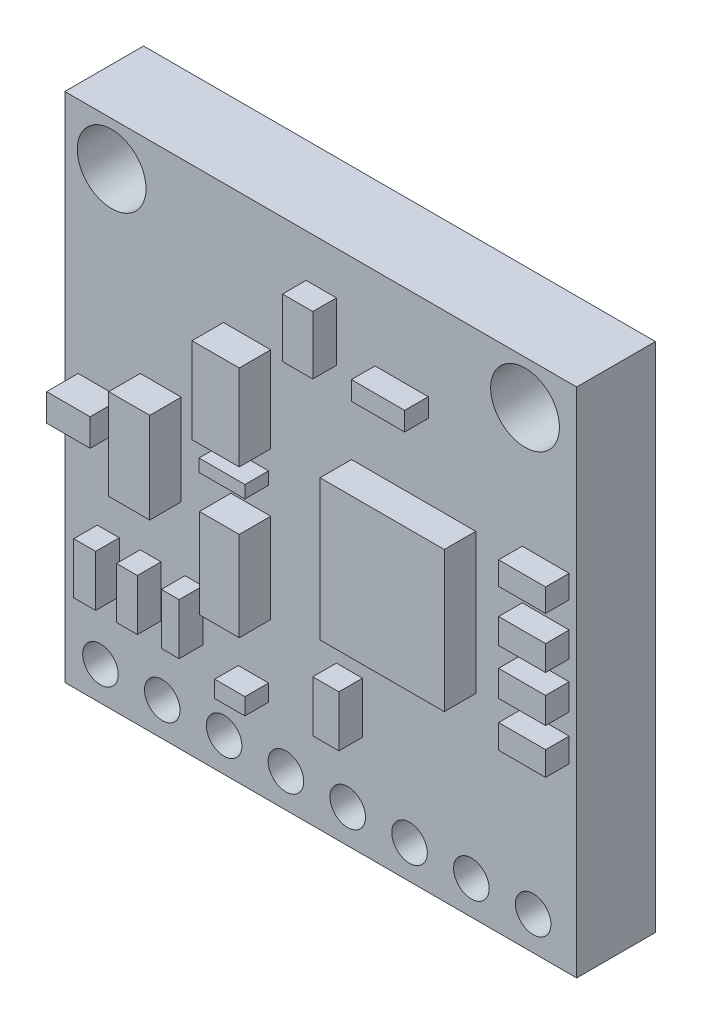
ISO-10303-21;
HEADER;
FILE_DESCRIPTION(('STEP AP214'),'2;1');
FILE_NAME('part.step','',(''),(''),'','','');
FILE_SCHEMA(('AUTOMOTIVE_DESIGN { 1 0 10303 214 1 1 1 1 }'));
ENDSEC;
DATA;
#1=APPLICATION_CONTEXT('core data for automotive mechanical design processes');
#2=APPLICATION_PROTOCOL_DEFINITION('international standard','automotive_design',2000,#1);
#3=PRODUCT_CONTEXT('',#1,'mechanical');
#4=PRODUCT('Part','Part','',(#3));
#5=PRODUCT_RELATED_PRODUCT_CATEGORY('part','',(#4));
#6=PRODUCT_DEFINITION_FORMATION('','',#4);
#7=PRODUCT_DEFINITION_CONTEXT('part definition',#1,'design');
#8=PRODUCT_DEFINITION('design','',#6,#7);
#9=PRODUCT_DEFINITION_SHAPE('','',#8);
#10=(LENGTH_UNIT() NAMED_UNIT(*) SI_UNIT(.MILLI.,.METRE.));
#11=(NAMED_UNIT(*) PLANE_ANGLE_UNIT() SI_UNIT($,.RADIAN.));
#12=(NAMED_UNIT(*) SI_UNIT($,.STERADIAN.) SOLID_ANGLE_UNIT());
#13=UNCERTAINTY_MEASURE_WITH_UNIT(LENGTH_MEASURE(1.E-05),#10,'distance_accuracy_value','');
#14=(GEOMETRIC_REPRESENTATION_CONTEXT(3) GLOBAL_UNCERTAINTY_ASSIGNED_CONTEXT((#13)) GLOBAL_UNIT_ASSIGNED_CONTEXT((#10,
#11,#12)) REPRESENTATION_CONTEXT('',''));
#15=CARTESIAN_POINT('',(0.,0.,0.));
#16=DIRECTION('',(0.,0.,1.));
#17=DIRECTION('',(1.,0.,0.));
#18=AXIS2_PLACEMENT_3D('',#15,#16,#17);
#19=CARTESIAN_POINT('',(0.,0.,0.2));
#20=DIRECTION('',(0.,0.,1.));
#21=DIRECTION('',(1.,0.,0.));
#22=AXIS2_PLACEMENT_3D('',#19,#20,#21);
#23=PLANE('',#22);
#24=DIRECTION('',(1.,0.,0.));
#25=VECTOR('',#24,1.);
#26=CARTESIAN_POINT('',(-61.9275330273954,10.5616970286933,0.2));
#27=LINE('',#26,#25);
#28=CARTESIAN_POINT('',(-61.9275330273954,10.5616970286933,0.2));
#29=VERTEX_POINT('',#28);
#30=CARTESIAN_POINT('',(-61.8612464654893,10.5616970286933,0.2));
#31=VERTEX_POINT('',#30);
#32=EDGE_CURVE('E510',#29,#31,#27,.T.);
#33=ORIENTED_EDGE('',*,*,#32,.F.);
#34=DIRECTION('',(0.,-1.,0.));
#35=VECTOR('',#34,1.);
#36=CARTESIAN_POINT('',(-61.9275330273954,10.6916186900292,0.2));
#37=LINE('',#36,#35);
#38=CARTESIAN_POINT('',(-61.9275330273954,10.6916186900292,0.2));
#39=VERTEX_POINT('',#38);
#40=EDGE_CURVE('E507',#39,#29,#37,.T.);
#41=ORIENTED_EDGE('',*,*,#40,.F.);
#42=DIRECTION('',(-1.,0.,0.));
#43=VECTOR('',#42,1.);
#44=CARTESIAN_POINT('',(-61.9275330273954,10.6916186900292,0.2));
#45=LINE('',#44,#43);
#46=CARTESIAN_POINT('',(-61.8612464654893,10.6916186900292,0.2));
#47=VERTEX_POINT('',#46);
#48=EDGE_CURVE('E519',#47,#39,#45,.T.);
#49=ORIENTED_EDGE('',*,*,#48,.F.);
#50=DIRECTION('',(0.,1.,0.));
#51=VECTOR('',#50,1.);
#52=CARTESIAN_POINT('',(-61.8612464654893,10.6916186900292,0.2));
#53=LINE('',#52,#51);
#54=EDGE_CURVE('E527',#31,#47,#53,.T.);
#55=ORIENTED_EDGE('',*,*,#54,.F.);
#56=EDGE_LOOP('',(#33,#41,#49,#55));
#57=FACE_BOUND('',#56,.T.);
#58=DIRECTION('',(1.,0.,0.));
#59=VECTOR('',#58,1.);
#60=CARTESIAN_POINT('',(-62.3119950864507,10.5616970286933,0.2));
#61=LINE('',#60,#59);
#62=CARTESIAN_POINT('',(-62.3119950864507,10.5616970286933,0.2));
#63=VERTEX_POINT('',#62);
#64=CARTESIAN_POINT('',(-62.2669202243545,10.5616970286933,0.2));
#65=VERTEX_POINT('',#64);
#66=EDGE_CURVE('E581',#63,#65,#61,.T.);
#67=ORIENTED_EDGE('',*,*,#66,.F.);
#68=DIRECTION('',(0.,-1.,0.));
#69=VECTOR('',#68,1.);
#70=CARTESIAN_POINT('',(-62.3119950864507,10.6916186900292,0.2));
#71=LINE('',#70,#69);
#72=CARTESIAN_POINT('',(-62.3119950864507,10.6916186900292,0.2));
#73=VERTEX_POINT('',#72);
#74=EDGE_CURVE('E567',#73,#63,#71,.T.);
#75=ORIENTED_EDGE('',*,*,#74,.F.);
#76=DIRECTION('',(-1.,0.,0.));
#77=VECTOR('',#76,1.);
#78=CARTESIAN_POINT('',(-62.3119950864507,10.6916186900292,0.2));
#79=LINE('',#78,#77);
#80=CARTESIAN_POINT('',(-62.2669202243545,10.6916186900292,0.2));
#81=VERTEX_POINT('',#80);
#82=EDGE_CURVE('E572',#81,#73,#79,.T.);
#83=ORIENTED_EDGE('',*,*,#82,.F.);
#84=DIRECTION('',(0.,1.,0.));
#85=VECTOR('',#84,1.);
#86=CARTESIAN_POINT('',(-62.2669202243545,10.6916186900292,0.2));
#87=LINE('',#86,#85);
#88=EDGE_CURVE('E583',#65,#81,#87,.T.);
#89=ORIENTED_EDGE('',*,*,#88,.F.);
#90=EDGE_LOOP('',(#67,#75,#83,#89));
#91=FACE_BOUND('',#90,.T.);
#92=DIRECTION('',(1.,0.,0.));
#93=VECTOR('',#92,1.);
#94=CARTESIAN_POINT('',(-62.5347179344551,10.5616970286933,0.2));
#95=LINE('',#94,#93);
#96=CARTESIAN_POINT('',(-62.5347179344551,10.5616970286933,0.2));
#97=VERTEX_POINT('',#96);
#98=CARTESIAN_POINT('',(-62.479037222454,10.5616970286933,0.2));
#99=VERTEX_POINT('',#98);
#100=EDGE_CURVE('E639',#97,#99,#95,.T.);
#101=ORIENTED_EDGE('',*,*,#100,.F.);
#102=DIRECTION('',(0.,-1.,0.));
#103=VECTOR('',#102,1.);
#104=CARTESIAN_POINT('',(-62.5347179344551,10.6916186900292,0.2));
#105=LINE('',#104,#103);
#106=CARTESIAN_POINT('',(-62.5347179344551,10.6916186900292,0.2));
#107=VERTEX_POINT('',#106);
#108=EDGE_CURVE('E625',#107,#97,#105,.T.);
#109=ORIENTED_EDGE('',*,*,#108,.F.);
#110=DIRECTION('',(-1.,0.,0.));
#111=VECTOR('',#110,1.);
#112=CARTESIAN_POINT('',(-62.5347179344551,10.6916186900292,0.2));
#113=LINE('',#112,#111);
#114=CARTESIAN_POINT('',(-62.479037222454,10.6916186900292,0.2));
#115=VERTEX_POINT('',#114);
#116=EDGE_CURVE('E630',#115,#107,#113,.T.);
#117=ORIENTED_EDGE('',*,*,#116,.F.);
#118=DIRECTION('',(0.,1.,0.));
#119=VECTOR('',#118,1.);
#120=CARTESIAN_POINT('',(-62.479037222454,10.6916186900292,0.2));
#121=LINE('',#120,#119);
#122=EDGE_CURVE('E641',#99,#115,#121,.T.);
#123=ORIENTED_EDGE('',*,*,#122,.F.);
#124=EDGE_LOOP('',(#101,#109,#117,#123));
#125=FACE_BOUND('',#124,.T.);
#126=DIRECTION('',(1.,0.,0.));
#127=VECTOR('',#126,1.);
#128=CARTESIAN_POINT('',(-61.4555727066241,10.8798725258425,0.2));
#129=LINE('',#128,#127);
#130=CARTESIAN_POINT('',(-61.4555727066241,10.8798725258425,0.2));
#131=VERTEX_POINT('',#130);
#132=CARTESIAN_POINT('',(-61.3362568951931,10.8798725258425,0.2));
#133=VERTEX_POINT('',#132);
#134=EDGE_CURVE('E697',#131,#133,#129,.T.);
#135=ORIENTED_EDGE('',*,*,#134,.F.);
#136=DIRECTION('',(0.,-1.,0.));
#137=VECTOR('',#136,1.);
#138=CARTESIAN_POINT('',(-61.4555727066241,10.9461590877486,0.2));
#139=LINE('',#138,#137);
#140=CARTESIAN_POINT('',(-61.4555727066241,10.9461590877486,0.2));
#141=VERTEX_POINT('',#140);
#142=EDGE_CURVE('E683',#141,#131,#139,.T.);
#143=ORIENTED_EDGE('',*,*,#142,.F.);
#144=DIRECTION('',(-1.,0.,0.));
#145=VECTOR('',#144,1.);
#146=CARTESIAN_POINT('',(-61.4555727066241,10.9461590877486,0.2));
#147=LINE('',#146,#145);
#148=CARTESIAN_POINT('',(-61.3362568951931,10.9461590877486,0.2));
#149=VERTEX_POINT('',#148);
#150=EDGE_CURVE('E688',#149,#141,#147,.T.);
#151=ORIENTED_EDGE('',*,*,#150,.F.);
#152=DIRECTION('',(0.,1.,0.));
#153=VECTOR('',#152,1.);
#154=CARTESIAN_POINT('',(-61.3362568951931,10.9461590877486,0.2));
#155=LINE('',#154,#153);
#156=EDGE_CURVE('E699',#133,#149,#155,.T.);
#157=ORIENTED_EDGE('',*,*,#156,.F.);
#158=EDGE_LOOP('',(#135,#143,#151,#157));
#159=FACE_BOUND('',#158,.T.);
#160=DIRECTION('',(1.,0.,0.));
#161=VECTOR('',#160,1.);
#162=CARTESIAN_POINT('',(-61.4555727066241,11.1264585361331,0.2));
#163=LINE('',#162,#161);
#164=CARTESIAN_POINT('',(-61.4555727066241,11.1264585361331,0.2));
#165=VERTEX_POINT('',#164);
#166=CARTESIAN_POINT('',(-61.3362568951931,11.1264585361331,0.2));
#167=VERTEX_POINT('',#166);
#168=EDGE_CURVE('E755',#165,#167,#163,.T.);
#169=ORIENTED_EDGE('',*,*,#168,.F.);
#170=DIRECTION('',(0.,-1.,0.));
#171=VECTOR('',#170,1.);
#172=CARTESIAN_POINT('',(-61.4555727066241,11.1847907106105,0.2));
#173=LINE('',#172,#171);
#174=CARTESIAN_POINT('',(-61.4555727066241,11.1847907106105,0.2));
#175=VERTEX_POINT('',#174);
#176=EDGE_CURVE('E741',#175,#165,#173,.T.);
#177=ORIENTED_EDGE('',*,*,#176,.F.);
#178=DIRECTION('',(-1.,0.,0.));
#179=VECTOR('',#178,1.);
#180=CARTESIAN_POINT('',(-61.4555727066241,11.1847907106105,0.2));
#181=LINE('',#180,#179);
#182=CARTESIAN_POINT('',(-61.3362568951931,11.1847907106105,0.2));
#183=VERTEX_POINT('',#182);
#184=EDGE_CURVE('E746',#183,#175,#181,.T.);
#185=ORIENTED_EDGE('',*,*,#184,.F.);
#186=DIRECTION('',(0.,1.,0.));
#187=VECTOR('',#186,1.);
#188=CARTESIAN_POINT('',(-61.3362568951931,11.1847907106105,0.2));
#189=LINE('',#188,#187);
#190=EDGE_CURVE('E757',#167,#183,#189,.T.);
#191=ORIENTED_EDGE('',*,*,#190,.F.);
#192=EDGE_LOOP('',(#169,#177,#185,#191));
#193=FACE_BOUND('',#192,.T.);
#194=DIRECTION('',(1.,0.,0.));
#195=VECTOR('',#194,1.);
#196=CARTESIAN_POINT('',(-62.0044254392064,11.3465299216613,0.2));
#197=LINE('',#196,#195);
#198=CARTESIAN_POINT('',(-62.0044254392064,11.3465299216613,0.2));
#199=VERTEX_POINT('',#198);
#200=CARTESIAN_POINT('',(-61.9275330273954,11.3465299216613,0.2));
#201=VERTEX_POINT('',#200);
#202=EDGE_CURVE('E813',#199,#201,#197,.T.);
#203=ORIENTED_EDGE('',*,*,#202,.F.);
#204=DIRECTION('',(0.,-1.,0.));
#205=VECTOR('',#204,1.);
#206=CARTESIAN_POINT('',(-62.0044254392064,11.495011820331,0.2));
#207=LINE('',#206,#205);
#208=CARTESIAN_POINT('',(-62.0044254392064,11.495011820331,0.2));
#209=VERTEX_POINT('',#208);
#210=EDGE_CURVE('E799',#209,#199,#207,.T.);
#211=ORIENTED_EDGE('',*,*,#210,.F.);
#212=DIRECTION('',(-1.,0.,0.));
#213=VECTOR('',#212,1.);
#214=CARTESIAN_POINT('',(-62.0044254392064,11.495011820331,0.2));
#215=LINE('',#214,#213);
#216=CARTESIAN_POINT('',(-61.9275330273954,11.495011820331,0.2));
#217=VERTEX_POINT('',#216);
#218=EDGE_CURVE('E804',#217,#209,#215,.T.);
#219=ORIENTED_EDGE('',*,*,#218,.F.);
#220=DIRECTION('',(0.,1.,0.));
#221=VECTOR('',#220,1.);
#222=CARTESIAN_POINT('',(-61.9275330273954,11.495011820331,0.2));
#223=LINE('',#222,#221);
#224=EDGE_CURVE('E815',#201,#217,#223,.T.);
#225=ORIENTED_EDGE('',*,*,#224,.F.);
#226=EDGE_LOOP('',(#203,#211,#219,#225));
#227=FACE_BOUND('',#226,.T.);
#228=DIRECTION('',(1.,0.,0.));
#229=VECTOR('',#228,1.);
#230=CARTESIAN_POINT('',(-62.4258010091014,10.8492003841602,0.2));
#231=LINE('',#230,#229);
#232=CARTESIAN_POINT('',(-62.4258010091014,10.8492003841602,0.2));
#233=VERTEX_POINT('',#232);
#234=CARTESIAN_POINT('',(-62.321641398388,10.8492003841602,0.2));
#235=VERTEX_POINT('',#234);
#236=EDGE_CURVE('E871',#233,#235,#231,.T.);
#237=ORIENTED_EDGE('',*,*,#236,.F.);
#238=DIRECTION('',(0.,-1.,0.));
#239=VECTOR('',#238,1.);
#240=CARTESIAN_POINT('',(-62.4258010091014,11.0796140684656,0.2));
#241=LINE('',#240,#239);
#242=CARTESIAN_POINT('',(-62.4258010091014,11.0796140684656,0.2));
#243=VERTEX_POINT('',#242);
#244=EDGE_CURVE('E857',#243,#233,#241,.T.);
#245=ORIENTED_EDGE('',*,*,#244,.F.);
#246=DIRECTION('',(-1.,0.,0.));
#247=VECTOR('',#246,1.);
#248=CARTESIAN_POINT('',(-62.4258010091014,11.0796140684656,0.2));
#249=LINE('',#248,#247);
#250=CARTESIAN_POINT('',(-62.321641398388,11.0796140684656,0.2));
#251=VERTEX_POINT('',#250);
#252=EDGE_CURVE('E862',#251,#243,#249,.T.);
#253=ORIENTED_EDGE('',*,*,#252,.F.);
#254=DIRECTION('',(0.,1.,0.));
#255=VECTOR('',#254,1.);
#256=CARTESIAN_POINT('',(-62.321641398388,11.0796140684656,0.2));
#257=LINE('',#256,#255);
#258=EDGE_CURVE('E873',#235,#251,#257,.T.);
#259=ORIENTED_EDGE('',*,*,#258,.F.);
#260=EDGE_LOOP('',(#237,#245,#253,#259));
#261=FACE_BOUND('',#260,.T.);
#262=DIRECTION('',(1.,0.,0.));
#263=VECTOR('',#262,1.);
#264=CARTESIAN_POINT('',(-62.195387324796,10.7040081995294,0.2));
#265=LINE('',#264,#263);
#266=CARTESIAN_POINT('',(-62.195387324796,10.7040081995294,0.2));
#267=VERTEX_POINT('',#266);
#268=CARTESIAN_POINT('',(-62.0943840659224,10.7040081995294,0.2));
#269=VERTEX_POINT('',#268);
#270=EDGE_CURVE('E929',#267,#269,#265,.T.);
#271=ORIENTED_EDGE('',*,*,#270,.F.);
#272=DIRECTION('',(0.,-1.,0.));
#273=VECTOR('',#272,1.);
#274=CARTESIAN_POINT('',(-62.195387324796,10.931265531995,0.2));
#275=LINE('',#274,#273);
#276=CARTESIAN_POINT('',(-62.195387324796,10.931265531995,0.2));
#277=VERTEX_POINT('',#276);
#278=EDGE_CURVE('E915',#277,#267,#275,.T.);
#279=ORIENTED_EDGE('',*,*,#278,.F.);
#280=DIRECTION('',(-1.,0.,0.));
#281=VECTOR('',#280,1.);
#282=CARTESIAN_POINT('',(-62.195387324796,10.931265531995,0.2));
#283=LINE('',#282,#281);
#284=CARTESIAN_POINT('',(-62.0943840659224,10.931265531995,0.2));
#285=VERTEX_POINT('',#284);
#286=EDGE_CURVE('E920',#285,#277,#283,.T.);
#287=ORIENTED_EDGE('',*,*,#286,.F.);
#288=DIRECTION('',(0.,1.,0.));
#289=VECTOR('',#288,1.);
#290=CARTESIAN_POINT('',(-62.0943840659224,10.931265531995,0.2));
#291=LINE('',#290,#289);
#292=EDGE_CURVE('E931',#269,#285,#291,.T.);
#293=ORIENTED_EDGE('',*,*,#292,.F.);
#294=EDGE_LOOP('',(#271,#279,#287,#293));
#295=FACE_BOUND('',#294,.T.);
#296=DIRECTION('',(0.,-1.,0.));
#297=VECTOR('',#296,1.);
#298=CARTESIAN_POINT('',(-62.617304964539,11.6041134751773,0.2));
#299=LINE('',#298,#297);
#300=CARTESIAN_POINT('',(-62.617304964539,11.6041134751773,0.2));
#301=VERTEX_POINT('',#300);
#302=CARTESIAN_POINT('',(-62.617304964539,10.3041134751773,0.2));
#303=VERTEX_POINT('',#302);
#304=EDGE_CURVE('E1034',#301,#303,#299,.T.);
#305=ORIENTED_EDGE('',*,*,#304,.T.);
#306=DIRECTION('',(1.,0.,0.));
#307=VECTOR('',#306,1.);
#308=CARTESIAN_POINT('',(-62.617304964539,10.3041134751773,0.2));
#309=LINE('',#308,#307);
#310=CARTESIAN_POINT('',(-61.317304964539,10.3041134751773,0.2));
#311=VERTEX_POINT('',#310);
#312=EDGE_CURVE('E1037',#303,#311,#309,.T.);
#313=ORIENTED_EDGE('',*,*,#312,.T.);
#314=DIRECTION('',(0.,1.,0.));
#315=VECTOR('',#314,1.);
#316=CARTESIAN_POINT('',(-61.317304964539,11.6041134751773,0.2));
#317=LINE('',#316,#315);
#318=CARTESIAN_POINT('',(-61.317304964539,11.6041134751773,0.2));
#319=VERTEX_POINT('',#318);
#320=EDGE_CURVE('E1040',#311,#319,#317,.T.);
#321=ORIENTED_EDGE('',*,*,#320,.T.);
#322=DIRECTION('',(-1.,0.,0.));
#323=VECTOR('',#322,1.);
#324=CARTESIAN_POINT('',(-62.617304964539,11.6041134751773,0.2));
#325=LINE('',#324,#323);
#326=EDGE_CURVE('E1042',#319,#301,#325,.T.);
#327=ORIENTED_EDGE('',*,*,#326,.T.);
#328=EDGE_LOOP('',(#305,#313,#321,#327));
#329=FACE_BOUND('',#328,.T.);
#330=CARTESIAN_POINT('',(-62.5267635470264,10.3893519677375,0.2));
#331=DIRECTION('',(0.,0.,1.));
#332=DIRECTION('',(1.,0.,0.));
#333=AXIS2_PLACEMENT_3D('',#330,#331,#332);
#334=CIRCLE('',#333,0.0451527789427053);
#335=CARTESIAN_POINT('',(-62.4816107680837,10.3893519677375,0.2));
#336=VERTEX_POINT('',#335);
#337=EDGE_CURVE('E1025',#336,#336,#334,.T.);
#338=ORIENTED_EDGE('',*,*,#337,.F.);
#339=EDGE_LOOP('',(#338));
#340=FACE_BOUND('',#339,.T.);
#341=CARTESIAN_POINT('',(-62.4983971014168,11.4930961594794,0.2));
#342=DIRECTION('',(0.,0.,1.));
#343=DIRECTION('',(1.,0.,0.));
#344=AXIS2_PLACEMENT_3D('',#341,#342,#343);
#345=CIRCLE('',#344,0.0873003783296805);
#346=CARTESIAN_POINT('',(-62.4110967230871,11.4930961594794,0.2));
#347=VERTEX_POINT('',#346);
#348=EDGE_CURVE('E1019',#347,#347,#345,.T.);
#349=ORIENTED_EDGE('',*,*,#348,.F.);
#350=EDGE_LOOP('',(#349));
#351=FACE_BOUND('',#350,.T.);
#352=CARTESIAN_POINT('',(-62.3697635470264,10.3893519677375,0.2));
#353=DIRECTION('',(0.,0.,1.));
#354=DIRECTION('',(1.,0.,0.));
#355=AXIS2_PLACEMENT_3D('',#352,#353,#354);
#356=CIRCLE('',#355,0.0451527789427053);
#357=CARTESIAN_POINT('',(-62.3246107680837,10.3893519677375,0.2));
#358=VERTEX_POINT('',#357);
#359=EDGE_CURVE('E1013',#358,#358,#356,.T.);
#360=ORIENTED_EDGE('',*,*,#359,.F.);
#361=EDGE_LOOP('',(#360));
#362=FACE_BOUND('',#361,.T.);
#363=CARTESIAN_POINT('',(-62.2127635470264,10.3893519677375,0.2));
#364=DIRECTION('',(0.,0.,1.));
#365=DIRECTION('',(1.,0.,0.));
#366=AXIS2_PLACEMENT_3D('',#363,#364,#365);
#367=CIRCLE('',#366,0.0451527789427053);
#368=CARTESIAN_POINT('',(-62.1676107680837,10.3893519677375,0.2));
#369=VERTEX_POINT('',#368);
#370=EDGE_CURVE('E1007',#369,#369,#367,.T.);
#371=ORIENTED_EDGE('',*,*,#370,.F.);
#372=EDGE_LOOP('',(#371));
#373=FACE_BOUND('',#372,.T.);
#374=CARTESIAN_POINT('',(-62.0557635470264,10.3893519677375,0.2));
#375=DIRECTION('',(0.,0.,1.));
#376=DIRECTION('',(1.,0.,0.));
#377=AXIS2_PLACEMENT_3D('',#374,#375,#376);
#378=CIRCLE('',#377,0.0451527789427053);
#379=CARTESIAN_POINT('',(-62.0106107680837,10.3893519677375,0.2));
#380=VERTEX_POINT('',#379);
#381=EDGE_CURVE('E1001',#380,#380,#378,.T.);
#382=ORIENTED_EDGE('',*,*,#381,.F.);
#383=EDGE_LOOP('',(#382));
#384=FACE_BOUND('',#383,.T.);
#385=CARTESIAN_POINT('',(-61.8987635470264,10.3893519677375,0.2));
#386=DIRECTION('',(0.,0.,1.));
#387=DIRECTION('',(1.,0.,0.));
#388=AXIS2_PLACEMENT_3D('',#385,#386,#387);
#389=CIRCLE('',#388,0.0451527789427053);
#390=CARTESIAN_POINT('',(-61.8536107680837,10.3893519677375,0.2));
#391=VERTEX_POINT('',#390);
#392=EDGE_CURVE('E995',#391,#391,#389,.T.);
#393=ORIENTED_EDGE('',*,*,#392,.F.);
#394=EDGE_LOOP('',(#393));
#395=FACE_BOUND('',#394,.T.);
#396=CARTESIAN_POINT('',(-61.7417635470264,10.3893519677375,0.2));
#397=DIRECTION('',(0.,0.,1.));
#398=DIRECTION('',(1.,0.,0.));
#399=AXIS2_PLACEMENT_3D('',#396,#397,#398);
#400=CIRCLE('',#399,0.0451527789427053);
#401=CARTESIAN_POINT('',(-61.6966107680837,10.3893519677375,0.2));
#402=VERTEX_POINT('',#401);
#403=EDGE_CURVE('E989',#402,#402,#400,.T.);
#404=ORIENTED_EDGE('',*,*,#403,.F.);
#405=EDGE_LOOP('',(#404));
#406=FACE_BOUND('',#405,.T.);
#407=CARTESIAN_POINT('',(-61.5847635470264,10.3893519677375,0.2));
#408=DIRECTION('',(0.,0.,1.));
#409=DIRECTION('',(1.,0.,0.));
#410=AXIS2_PLACEMENT_3D('',#407,#408,#409);
#411=CIRCLE('',#410,0.0451527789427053);
#412=CARTESIAN_POINT('',(-61.5396107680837,10.3893519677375,0.2));
#413=VERTEX_POINT('',#412);
#414=EDGE_CURVE('E983',#413,#413,#411,.T.);
#415=ORIENTED_EDGE('',*,*,#414,.F.);
#416=EDGE_LOOP('',(#415));
#417=FACE_BOUND('',#416,.T.);
#418=CARTESIAN_POINT('',(-61.4277635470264,10.3893519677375,0.2));
#419=DIRECTION('',(0.,0.,1.));
#420=DIRECTION('',(1.,0.,0.));
#421=AXIS2_PLACEMENT_3D('',#418,#419,#420);
#422=CIRCLE('',#421,0.0451527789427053);
#423=CARTESIAN_POINT('',(-61.3826107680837,10.3893519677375,0.2));
#424=VERTEX_POINT('',#423);
#425=EDGE_CURVE('E977',#424,#424,#422,.T.);
#426=ORIENTED_EDGE('',*,*,#425,.F.);
#427=EDGE_LOOP('',(#426));
#428=FACE_BOUND('',#427,.T.);
#429=CARTESIAN_POINT('',(-61.4483971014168,11.4930961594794,0.2));
#430=DIRECTION('',(0.,0.,1.));
#431=DIRECTION('',(1.,0.,0.));
#432=AXIS2_PLACEMENT_3D('',#429,#430,#431);
#433=CIRCLE('',#432,0.0873003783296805);
#434=CARTESIAN_POINT('',(-61.3610967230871,11.4930961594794,0.2));
#435=VERTEX_POINT('',#434);
#436=EDGE_CURVE('E973',#435,#435,#433,.T.);
#437=ORIENTED_EDGE('',*,*,#436,.F.);
#438=EDGE_LOOP('',(#437));
#439=FACE_BOUND('',#438,.T.);
#440=DIRECTION('',(1.,0.,0.));
#441=VECTOR('',#440,1.);
#442=CARTESIAN_POINT('',(-61.8892211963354,10.8018551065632,0.2));
#443=LINE('',#442,#441);
#444=CARTESIAN_POINT('',(-61.8892211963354,10.8018551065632,0.2));
#445=VERTEX_POINT('',#444);
#446=CARTESIAN_POINT('',(-61.5735860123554,10.8018551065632,0.2));
#447=VERTEX_POINT('',#446);
#448=EDGE_CURVE('E958',#445,#447,#443,.T.);
#449=ORIENTED_EDGE('',*,*,#448,.F.);
#450=DIRECTION('',(0.,-1.,0.));
#451=VECTOR('',#450,1.);
#452=CARTESIAN_POINT('',(-61.8892211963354,11.1585228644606,0.2));
#453=LINE('',#452,#451);
#454=CARTESIAN_POINT('',(-61.8892211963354,11.1585228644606,0.2));
#455=VERTEX_POINT('',#454);
#456=EDGE_CURVE('E944',#455,#445,#453,.T.);
#457=ORIENTED_EDGE('',*,*,#456,.F.);
#458=DIRECTION('',(-1.,0.,0.));
#459=VECTOR('',#458,1.);
#460=CARTESIAN_POINT('',(-61.8892211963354,11.1585228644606,0.2));
#461=LINE('',#460,#459);
#462=CARTESIAN_POINT('',(-61.5735860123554,11.1585228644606,0.2));
#463=VERTEX_POINT('',#462);
#464=EDGE_CURVE('E949',#463,#455,#461,.T.);
#465=ORIENTED_EDGE('',*,*,#464,.F.);
#466=DIRECTION('',(0.,1.,0.));
#467=VECTOR('',#466,1.);
#468=CARTESIAN_POINT('',(-61.5735860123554,11.1585228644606,0.2));
#469=LINE('',#468,#467);
#470=EDGE_CURVE('E960',#447,#463,#469,.T.);
#471=ORIENTED_EDGE('',*,*,#470,.F.);
#472=EDGE_LOOP('',(#449,#457,#465,#471));
#473=FACE_BOUND('',#472,.T.);
#474=DIRECTION('',(1.,0.,0.));
#475=VECTOR('',#474,1.);
#476=CARTESIAN_POINT('',(-62.2143254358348,11.0796140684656,0.2));
#477=LINE('',#476,#475);
#478=CARTESIAN_POINT('',(-62.2143254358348,11.0796140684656,0.2));
#479=VERTEX_POINT('',#478);
#480=CARTESIAN_POINT('',(-62.0943840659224,11.0796140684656,0.2));
#481=VERTEX_POINT('',#480);
#482=EDGE_CURVE('E900',#479,#481,#477,.T.);
#483=ORIENTED_EDGE('',*,*,#482,.F.);
#484=DIRECTION('',(0.,-1.,0.));
#485=VECTOR('',#484,1.);
#486=CARTESIAN_POINT('',(-62.2143254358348,11.2974023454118,0.2));
#487=LINE('',#486,#485);
#488=CARTESIAN_POINT('',(-62.2143254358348,11.2974023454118,0.2));
#489=VERTEX_POINT('',#488);
#490=EDGE_CURVE('E886',#489,#479,#487,.T.);
#491=ORIENTED_EDGE('',*,*,#490,.F.);
#492=DIRECTION('',(-1.,0.,0.));
#493=VECTOR('',#492,1.);
#494=CARTESIAN_POINT('',(-62.2143254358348,11.2974023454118,0.2));
#495=LINE('',#494,#493);
#496=CARTESIAN_POINT('',(-62.0943840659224,11.2974023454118,0.2));
#497=VERTEX_POINT('',#496);
#498=EDGE_CURVE('E891',#497,#489,#495,.T.);
#499=ORIENTED_EDGE('',*,*,#498,.F.);
#500=DIRECTION('',(0.,1.,0.));
#501=VECTOR('',#500,1.);
#502=CARTESIAN_POINT('',(-62.0943840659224,11.2974023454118,0.2));
#503=LINE('',#502,#501);
#504=EDGE_CURVE('E902',#481,#497,#503,.T.);
#505=ORIENTED_EDGE('',*,*,#504,.F.);
#506=EDGE_LOOP('',(#483,#491,#499,#505));
#507=FACE_BOUND('',#506,.T.);
#508=DIRECTION('',(1.,0.,0.));
#509=VECTOR('',#508,1.);
#510=CARTESIAN_POINT('',(-62.5836186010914,10.931265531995,0.2));
#511=LINE('',#510,#509);
#512=CARTESIAN_POINT('',(-62.5836186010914,10.931265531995,0.2));
#513=VERTEX_POINT('',#512);
#514=CARTESIAN_POINT('',(-62.4731462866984,10.931265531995,0.2));
#515=VERTEX_POINT('',#514);
#516=EDGE_CURVE('E842',#513,#515,#511,.T.);
#517=ORIENTED_EDGE('',*,*,#516,.F.);
#518=DIRECTION('',(0.,-1.,0.));
#519=VECTOR('',#518,1.);
#520=CARTESIAN_POINT('',(-62.5836186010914,11.0007052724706,0.2));
#521=LINE('',#520,#519);
#522=CARTESIAN_POINT('',(-62.5836186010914,11.0007052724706,0.2));
#523=VERTEX_POINT('',#522);
#524=EDGE_CURVE('E828',#523,#513,#521,.T.);
#525=ORIENTED_EDGE('',*,*,#524,.F.);
#526=DIRECTION('',(-1.,0.,0.));
#527=VECTOR('',#526,1.);
#528=CARTESIAN_POINT('',(-62.5836186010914,11.0007052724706,0.2));
#529=LINE('',#528,#527);
#530=CARTESIAN_POINT('',(-62.4731462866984,11.0007052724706,0.2));
#531=VERTEX_POINT('',#530);
#532=EDGE_CURVE('E833',#531,#523,#529,.T.);
#533=ORIENTED_EDGE('',*,*,#532,.F.);
#534=DIRECTION('',(0.,1.,0.));
#535=VECTOR('',#534,1.);
#536=CARTESIAN_POINT('',(-62.4731462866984,11.0007052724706,0.2));
#537=LINE('',#536,#535);
#538=EDGE_CURVE('E844',#515,#531,#537,.T.);
#539=ORIENTED_EDGE('',*,*,#538,.F.);
#540=EDGE_LOOP('',(#517,#525,#533,#539));
#541=FACE_BOUND('',#540,.T.);
#542=DIRECTION('',(1.,0.,0.));
#543=VECTOR('',#542,1.);
#544=CARTESIAN_POINT('',(-61.8294289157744,11.3465299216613,0.2));
#545=LINE('',#544,#543);
#546=CARTESIAN_POINT('',(-61.8294289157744,11.3465299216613,0.2));
#547=VERTEX_POINT('',#546);
#548=CARTESIAN_POINT('',(-61.694204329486,11.3465299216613,0.2));
#549=VERTEX_POINT('',#548);
#550=EDGE_CURVE('E784',#547,#549,#545,.T.);
#551=ORIENTED_EDGE('',*,*,#550,.F.);
#552=DIRECTION('',(0.,-1.,0.));
#553=VECTOR('',#552,1.);
#554=CARTESIAN_POINT('',(-61.8294289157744,11.3942562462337,0.2));
#555=LINE('',#554,#553);
#556=CARTESIAN_POINT('',(-61.8294289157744,11.3942562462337,0.2));
#557=VERTEX_POINT('',#556);
#558=EDGE_CURVE('E770',#557,#547,#555,.T.);
#559=ORIENTED_EDGE('',*,*,#558,.F.);
#560=DIRECTION('',(-1.,0.,0.));
#561=VECTOR('',#560,1.);
#562=CARTESIAN_POINT('',(-61.8294289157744,11.3942562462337,0.2));
#563=LINE('',#562,#561);
#564=CARTESIAN_POINT('',(-61.694204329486,11.3942562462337,0.2));
#565=VERTEX_POINT('',#564);
#566=EDGE_CURVE('E775',#565,#557,#563,.T.);
#567=ORIENTED_EDGE('',*,*,#566,.F.);
#568=DIRECTION('',(0.,1.,0.));
#569=VECTOR('',#568,1.);
#570=CARTESIAN_POINT('',(-61.694204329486,11.3942562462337,0.2));
#571=LINE('',#570,#569);
#572=EDGE_CURVE('E786',#549,#565,#571,.T.);
#573=ORIENTED_EDGE('',*,*,#572,.F.);
#574=EDGE_LOOP('',(#551,#559,#567,#573));
#575=FACE_BOUND('',#574,.T.);
#576=DIRECTION('',(1.,0.,0.));
#577=VECTOR('',#576,1.);
#578=CARTESIAN_POINT('',(-61.4555727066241,10.9965368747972,0.2));
#579=LINE('',#578,#577);
#580=CARTESIAN_POINT('',(-61.4555727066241,10.9965368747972,0.2));
#581=VERTEX_POINT('',#580);
#582=CARTESIAN_POINT('',(-61.3362568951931,10.9965368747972,0.2));
#583=VERTEX_POINT('',#582);
#584=EDGE_CURVE('E726',#581,#583,#579,.T.);
#585=ORIENTED_EDGE('',*,*,#584,.F.);
#586=DIRECTION('',(0.,-1.,0.));
#587=VECTOR('',#586,1.);
#588=CARTESIAN_POINT('',(-61.4555727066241,11.0601719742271,0.2));
#589=LINE('',#588,#587);
#590=CARTESIAN_POINT('',(-61.4555727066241,11.0601719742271,0.2));
#591=VERTEX_POINT('',#590);
#592=EDGE_CURVE('E712',#591,#581,#589,.T.);
#593=ORIENTED_EDGE('',*,*,#592,.F.);
#594=DIRECTION('',(-1.,0.,0.));
#595=VECTOR('',#594,1.);
#596=CARTESIAN_POINT('',(-61.4555727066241,11.0601719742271,0.2));
#597=LINE('',#596,#595);
#598=CARTESIAN_POINT('',(-61.3362568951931,11.0601719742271,0.2));
#599=VERTEX_POINT('',#598);
#600=EDGE_CURVE('E717',#599,#591,#597,.T.);
#601=ORIENTED_EDGE('',*,*,#600,.F.);
#602=DIRECTION('',(0.,1.,0.));
#603=VECTOR('',#602,1.);
#604=CARTESIAN_POINT('',(-61.3362568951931,11.0601719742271,0.2));
#605=LINE('',#604,#603);
#606=EDGE_CURVE('E728',#583,#599,#605,.T.);
#607=ORIENTED_EDGE('',*,*,#606,.F.);
#608=EDGE_LOOP('',(#585,#593,#601,#607));
#609=FACE_BOUND('',#608,.T.);
#610=DIRECTION('',(1.,0.,0.));
#611=VECTOR('',#610,1.);
#612=CARTESIAN_POINT('',(-61.4555727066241,10.765859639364,0.2));
#613=LINE('',#612,#611);
#614=CARTESIAN_POINT('',(-61.4555727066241,10.765859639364,0.2));
#615=VERTEX_POINT('',#614);
#616=CARTESIAN_POINT('',(-61.3362568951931,10.765859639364,0.2));
#617=VERTEX_POINT('',#616);
#618=EDGE_CURVE('E668',#615,#617,#613,.T.);
#619=ORIENTED_EDGE('',*,*,#618,.F.);
#620=DIRECTION('',(0.,-1.,0.));
#621=VECTOR('',#620,1.);
#622=CARTESIAN_POINT('',(-61.4555727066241,10.8268432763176,0.2));
#623=LINE('',#622,#621);
#624=CARTESIAN_POINT('',(-61.4555727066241,10.8268432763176,0.2));
#625=VERTEX_POINT('',#624);
#626=EDGE_CURVE('E654',#625,#615,#623,.T.);
#627=ORIENTED_EDGE('',*,*,#626,.F.);
#628=DIRECTION('',(-1.,0.,0.));
#629=VECTOR('',#628,1.);
#630=CARTESIAN_POINT('',(-61.4555727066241,10.8268432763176,0.2));
#631=LINE('',#630,#629);
#632=CARTESIAN_POINT('',(-61.3362568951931,10.8268432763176,0.2));
#633=VERTEX_POINT('',#632);
#634=EDGE_CURVE('E659',#633,#625,#631,.T.);
#635=ORIENTED_EDGE('',*,*,#634,.F.);
#636=DIRECTION('',(0.,1.,0.));
#637=VECTOR('',#636,1.);
#638=CARTESIAN_POINT('',(-61.3362568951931,10.8268432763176,0.2));
#639=LINE('',#638,#637);
#640=EDGE_CURVE('E670',#617,#633,#639,.T.);
#641=ORIENTED_EDGE('',*,*,#640,.F.);
#642=EDGE_LOOP('',(#619,#627,#635,#641));
#643=FACE_BOUND('',#642,.T.);
#644=DIRECTION('',(1.,0.,0.));
#645=VECTOR('',#644,1.);
#646=CARTESIAN_POINT('',(-62.4260079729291,10.5616970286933,0.2));
#647=LINE('',#646,#645);
#648=CARTESIAN_POINT('',(-62.4260079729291,10.5616970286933,0.2));
#649=VERTEX_POINT('',#648);
#650=CARTESIAN_POINT('',(-62.3729787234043,10.5616970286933,0.2));
#651=VERTEX_POINT('',#650);
#652=EDGE_CURVE('E610',#649,#651,#647,.T.);
#653=ORIENTED_EDGE('',*,*,#652,.F.);
#654=DIRECTION('',(0.,-1.,0.));
#655=VECTOR('',#654,1.);
#656=CARTESIAN_POINT('',(-62.4260079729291,10.6916186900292,0.2));
#657=LINE('',#656,#655);
#658=CARTESIAN_POINT('',(-62.4260079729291,10.6916186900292,0.2));
#659=VERTEX_POINT('',#658);
#660=EDGE_CURVE('E596',#659,#649,#657,.T.);
#661=ORIENTED_EDGE('',*,*,#660,.F.);
#662=DIRECTION('',(-1.,0.,0.));
#663=VECTOR('',#662,1.);
#664=CARTESIAN_POINT('',(-62.4260079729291,10.6916186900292,0.2));
#665=LINE('',#664,#663);
#666=CARTESIAN_POINT('',(-62.3729787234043,10.6916186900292,0.2));
#667=VERTEX_POINT('',#666);
#668=EDGE_CURVE('E601',#667,#659,#665,.T.);
#669=ORIENTED_EDGE('',*,*,#668,.F.);
#670=DIRECTION('',(0.,1.,0.));
#671=VECTOR('',#670,1.);
#672=CARTESIAN_POINT('',(-62.3729787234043,10.6916186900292,0.2));
#673=LINE('',#672,#671);
#674=EDGE_CURVE('E612',#651,#667,#673,.T.);
#675=ORIENTED_EDGE('',*,*,#674,.F.);
#676=EDGE_LOOP('',(#653,#661,#669,#675));
#677=FACE_BOUND('',#676,.T.);
#678=DIRECTION('',(1.,0.,0.));
#679=VECTOR('',#678,1.);
#680=CARTESIAN_POINT('',(-62.1767705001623,10.5192736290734,0.2));
#681=LINE('',#680,#679);
#682=CARTESIAN_POINT('',(-62.1767705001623,10.5192736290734,0.2));
#683=VERTEX_POINT('',#682);
#684=CARTESIAN_POINT('',(-62.0998780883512,10.5192736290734,0.2));
#685=VERTEX_POINT('',#684);
#686=EDGE_CURVE('E552',#683,#685,#681,.T.);
#687=ORIENTED_EDGE('',*,*,#686,.F.);
#688=DIRECTION('',(0.,-1.,0.));
#689=VECTOR('',#688,1.);
#690=CARTESIAN_POINT('',(-62.1767705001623,10.5616970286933,0.2));
#691=LINE('',#690,#689);
#692=CARTESIAN_POINT('',(-62.1767705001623,10.5616970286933,0.2));
#693=VERTEX_POINT('',#692);
#694=EDGE_CURVE('E538',#693,#683,#691,.T.);
#695=ORIENTED_EDGE('',*,*,#694,.F.);
#696=DIRECTION('',(-1.,0.,0.));
#697=VECTOR('',#696,1.);
#698=CARTESIAN_POINT('',(-62.1767705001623,10.5616970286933,0.2));
#699=LINE('',#698,#697);
#700=CARTESIAN_POINT('',(-62.0998780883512,10.5616970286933,0.2));
#701=VERTEX_POINT('',#700);
#702=EDGE_CURVE('E543',#701,#693,#699,.T.);
#703=ORIENTED_EDGE('',*,*,#702,.F.);
#704=DIRECTION('',(0.,1.,0.));
#705=VECTOR('',#704,1.);
#706=CARTESIAN_POINT('',(-62.0998780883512,10.5616970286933,0.2));
#707=LINE('',#706,#705);
#708=EDGE_CURVE('E554',#685,#701,#707,.T.);
#709=ORIENTED_EDGE('',*,*,#708,.F.);
#710=EDGE_LOOP('',(#687,#695,#703,#709));
#711=FACE_BOUND('',#710,.T.);
#712=DIRECTION('',(1.,0.,0.));
#713=VECTOR('',#712,1.);
#714=CARTESIAN_POINT('',(-62.2165424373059,10.9965368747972,0.2));
#715=LINE('',#714,#713);
#716=CARTESIAN_POINT('',(-62.2165424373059,10.9965368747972,0.2));
#717=VERTEX_POINT('',#716);
#718=CARTESIAN_POINT('',(-62.0998780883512,10.9965368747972,0.2));
#719=VERTEX_POINT('',#718);
#720=EDGE_CURVE('E2077',#717,#719,#715,.T.);
#721=ORIENTED_EDGE('',*,*,#720,.F.);
#722=DIRECTION('',(0.,-1.,0.));
#723=VECTOR('',#722,1.);
#724=CARTESIAN_POINT('',(-62.2165424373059,11.0283544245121,0.2));
#725=LINE('',#724,#723);
#726=CARTESIAN_POINT('',(-62.2165424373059,11.0283544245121,0.2));
#727=VERTEX_POINT('',#726);
#728=EDGE_CURVE('E505',#727,#717,#725,.T.);
#729=ORIENTED_EDGE('',*,*,#728,.F.);
#730=DIRECTION('',(-1.,0.,0.));
#731=VECTOR('',#730,1.);
#732=CARTESIAN_POINT('',(-62.2165424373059,11.0283544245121,0.2));
#733=LINE('',#732,#731);
#734=CARTESIAN_POINT('',(-62.0998780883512,11.0283544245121,0.2));
#735=VERTEX_POINT('',#734);
#736=EDGE_CURVE('E501',#735,#727,#733,.T.);
#737=ORIENTED_EDGE('',*,*,#736,.F.);
#738=DIRECTION('',(0.,1.,0.));
#739=VECTOR('',#738,1.);
#740=CARTESIAN_POINT('',(-62.0998780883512,11.0283544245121,0.2));
#741=LINE('',#740,#739);
#742=EDGE_CURVE('E2074',#719,#735,#741,.T.);
#743=ORIENTED_EDGE('',*,*,#742,.F.);
#744=EDGE_LOOP('',(#721,#729,#737,#743));
#745=FACE_BOUND('',#744,.T.);
#746=ADVANCED_FACE('F32',(#57,#91,#125,#159,#193,#227,#261,#295,#329,#340,#351,#362,#373,#384,
#395,#406,#417,#428,#439,#473,#507,#541,#575,#609,#643,#677,#711,#745),#23,.T.);
#747=CARTESIAN_POINT('',(-62.617304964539,11.6041134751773,0.2));
#748=DIRECTION('',(1.,0.,0.));
#749=DIRECTION('',(0.,0.,-1.));
#750=AXIS2_PLACEMENT_3D('',#747,#748,#749);
#751=PLANE('',#750);
#752=DIRECTION('',(0.,-1.,0.));
#753=VECTOR('',#752,1.);
#754=CARTESIAN_POINT('',(-62.617304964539,11.6041134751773,0.));
#755=LINE('',#754,#753);
#756=CARTESIAN_POINT('',(-62.617304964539,11.6041134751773,0.));
#757=VERTEX_POINT('',#756);
#758=CARTESIAN_POINT('',(-62.617304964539,10.3041134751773,0.));
#759=VERTEX_POINT('',#758);
#760=EDGE_CURVE('E1031',#757,#759,#755,.T.);
#761=ORIENTED_EDGE('',*,*,#760,.T.);
#762=DIRECTION('',(0.,0.,-1.));
#763=VECTOR('',#762,1.);
#764=CARTESIAN_POINT('',(-62.617304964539,10.3041134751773,0.2));
#765=LINE('',#764,#763);
#766=EDGE_CURVE('E11',#303,#759,#765,.T.);
#767=ORIENTED_EDGE('',*,*,#766,.F.);
#768=ORIENTED_EDGE('',*,*,#304,.F.);
#769=DIRECTION('',(0.,0.,-1.));
#770=VECTOR('',#769,1.);
#771=CARTESIAN_POINT('',(-62.617304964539,11.6041134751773,0.2));
#772=LINE('',#771,#770);
#773=EDGE_CURVE('E1044',#301,#757,#772,.T.);
#774=ORIENTED_EDGE('',*,*,#773,.T.);
#775=EDGE_LOOP('',(#761,#767,#768,#774));
#776=FACE_BOUND('',#775,.T.);
#777=ADVANCED_FACE('F34',(#776),#751,.F.);
#778=CARTESIAN_POINT('',(-62.617304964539,10.3041134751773,0.2));
#779=DIRECTION('',(0.,1.,0.));
#780=DIRECTION('',(0.,0.,1.));
#781=AXIS2_PLACEMENT_3D('',#778,#779,#780);
#782=PLANE('',#781);
#783=DIRECTION('',(1.,0.,0.));
#784=VECTOR('',#783,1.);
#785=CARTESIAN_POINT('',(-62.617304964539,10.3041134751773,0.));
#786=LINE('',#785,#784);
#787=CARTESIAN_POINT('',(-61.317304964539,10.3041134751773,0.));
#788=VERTEX_POINT('',#787);
#789=EDGE_CURVE('E1047',#759,#788,#786,.T.);
#790=ORIENTED_EDGE('',*,*,#789,.T.);
#791=DIRECTION('',(0.,0.,-1.));
#792=VECTOR('',#791,1.);
#793=CARTESIAN_POINT('',(-61.317304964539,10.3041134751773,0.2));
#794=LINE('',#793,#792);
#795=EDGE_CURVE('E40',#311,#788,#794,.T.);
#796=ORIENTED_EDGE('',*,*,#795,.F.);
#797=ORIENTED_EDGE('',*,*,#312,.F.);
#798=ORIENTED_EDGE('',*,*,#766,.T.);
#799=EDGE_LOOP('',(#790,#796,#797,#798));
#800=FACE_BOUND('',#799,.T.);
#801=ADVANCED_FACE('F1077',(#800),#782,.F.);
#802=CARTESIAN_POINT('',(-61.317304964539,11.6041134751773,0.2));
#803=DIRECTION('',(-1.,0.,0.));
#804=DIRECTION('',(0.,0.,1.));
#805=AXIS2_PLACEMENT_3D('',#802,#803,#804);
#806=PLANE('',#805);
#807=DIRECTION('',(0.,1.,0.));
#808=VECTOR('',#807,1.);
#809=CARTESIAN_POINT('',(-61.317304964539,11.6041134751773,0.));
#810=LINE('',#809,#808);
#811=CARTESIAN_POINT('',(-61.317304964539,11.6041134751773,0.));
#812=VERTEX_POINT('',#811);
#813=EDGE_CURVE('E1049',#788,#812,#810,.T.);
#814=ORIENTED_EDGE('',*,*,#813,.T.);
#815=DIRECTION('',(0.,0.,-1.));
#816=VECTOR('',#815,1.);
#817=CARTESIAN_POINT('',(-61.317304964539,11.6041134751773,0.2));
#818=LINE('',#817,#816);
#819=EDGE_CURVE('E1054',#319,#812,#818,.T.);
#820=ORIENTED_EDGE('',*,*,#819,.F.);
#821=ORIENTED_EDGE('',*,*,#320,.F.);
#822=ORIENTED_EDGE('',*,*,#795,.T.);
#823=EDGE_LOOP('',(#814,#820,#821,#822));
#824=FACE_BOUND('',#823,.T.);
#825=ADVANCED_FACE('F1061',(#824),#806,.F.);
#826=CARTESIAN_POINT('',(-62.617304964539,11.6041134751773,0.2));
#827=DIRECTION('',(0.,-1.,0.));
#828=DIRECTION('',(0.,0.,-1.));
#829=AXIS2_PLACEMENT_3D('',#826,#827,#828);
#830=PLANE('',#829);
#831=DIRECTION('',(-1.,0.,0.));
#832=VECTOR('',#831,1.);
#833=CARTESIAN_POINT('',(-62.617304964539,11.6041134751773,0.));
#834=LINE('',#833,#832);
#835=EDGE_CURVE('E1038',#812,#757,#834,.T.);
#836=ORIENTED_EDGE('',*,*,#835,.T.);
#837=ORIENTED_EDGE('',*,*,#773,.F.);
#838=ORIENTED_EDGE('',*,*,#326,.F.);
#839=ORIENTED_EDGE('',*,*,#819,.T.);
#840=EDGE_LOOP('',(#836,#837,#838,#839));
#841=FACE_BOUND('',#840,.T.);
#842=ADVANCED_FACE('F1070',(#841),#830,.F.);
#843=CARTESIAN_POINT('',(0.,0.,0.));
#844=DIRECTION('',(0.,0.,1.));
#845=DIRECTION('',(1.,0.,0.));
#846=AXIS2_PLACEMENT_3D('',#843,#844,#845);
#847=PLANE('',#846);
#848=CARTESIAN_POINT('',(-61.4483971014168,11.4930961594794,0.));
#849=DIRECTION('',(0.,0.,1.));
#850=DIRECTION('',(1.,0.,0.));
#851=AXIS2_PLACEMENT_3D('',#848,#849,#850);
#852=CIRCLE('',#851,0.0873003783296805);
#853=CARTESIAN_POINT('',(-61.3610967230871,11.4930961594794,0.));
#854=VERTEX_POINT('',#853);
#855=EDGE_CURVE('E974',#854,#854,#852,.T.);
#856=ORIENTED_EDGE('',*,*,#855,.T.);
#857=EDGE_LOOP('',(#856));
#858=FACE_BOUND('',#857,.T.);
#859=CARTESIAN_POINT('',(-61.4277635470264,10.3893519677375,0.));
#860=DIRECTION('',(0.,0.,1.));
#861=DIRECTION('',(1.,0.,0.));
#862=AXIS2_PLACEMENT_3D('',#859,#860,#861);
#863=CIRCLE('',#862,0.0451527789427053);
#864=CARTESIAN_POINT('',(-61.3826107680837,10.3893519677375,0.));
#865=VERTEX_POINT('',#864);
#866=EDGE_CURVE('E980',#865,#865,#863,.T.);
#867=ORIENTED_EDGE('',*,*,#866,.T.);
#868=EDGE_LOOP('',(#867));
#869=FACE_BOUND('',#868,.T.);
#870=CARTESIAN_POINT('',(-61.5847635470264,10.3893519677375,0.));
#871=DIRECTION('',(0.,0.,1.));
#872=DIRECTION('',(1.,0.,0.));
#873=AXIS2_PLACEMENT_3D('',#870,#871,#872);
#874=CIRCLE('',#873,0.0451527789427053);
#875=CARTESIAN_POINT('',(-61.5396107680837,10.3893519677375,0.));
#876=VERTEX_POINT('',#875);
#877=EDGE_CURVE('E986',#876,#876,#874,.T.);
#878=ORIENTED_EDGE('',*,*,#877,.T.);
#879=EDGE_LOOP('',(#878));
#880=FACE_BOUND('',#879,.T.);
#881=CARTESIAN_POINT('',(-61.7417635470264,10.3893519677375,0.));
#882=DIRECTION('',(0.,0.,1.));
#883=DIRECTION('',(1.,0.,0.));
#884=AXIS2_PLACEMENT_3D('',#881,#882,#883);
#885=CIRCLE('',#884,0.0451527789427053);
#886=CARTESIAN_POINT('',(-61.6966107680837,10.3893519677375,0.));
#887=VERTEX_POINT('',#886);
#888=EDGE_CURVE('E992',#887,#887,#885,.T.);
#889=ORIENTED_EDGE('',*,*,#888,.T.);
#890=EDGE_LOOP('',(#889));
#891=FACE_BOUND('',#890,.T.);
#892=CARTESIAN_POINT('',(-61.8987635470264,10.3893519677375,0.));
#893=DIRECTION('',(0.,0.,1.));
#894=DIRECTION('',(1.,0.,0.));
#895=AXIS2_PLACEMENT_3D('',#892,#893,#894);
#896=CIRCLE('',#895,0.0451527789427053);
#897=CARTESIAN_POINT('',(-61.8536107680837,10.3893519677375,0.));
#898=VERTEX_POINT('',#897);
#899=EDGE_CURVE('E998',#898,#898,#896,.T.);
#900=ORIENTED_EDGE('',*,*,#899,.T.);
#901=EDGE_LOOP('',(#900));
#902=FACE_BOUND('',#901,.T.);
#903=CARTESIAN_POINT('',(-62.0557635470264,10.3893519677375,0.));
#904=DIRECTION('',(0.,0.,1.));
#905=DIRECTION('',(1.,0.,0.));
#906=AXIS2_PLACEMENT_3D('',#903,#904,#905);
#907=CIRCLE('',#906,0.0451527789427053);
#908=CARTESIAN_POINT('',(-62.0106107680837,10.3893519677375,0.));
#909=VERTEX_POINT('',#908);
#910=EDGE_CURVE('E1004',#909,#909,#907,.T.);
#911=ORIENTED_EDGE('',*,*,#910,.T.);
#912=EDGE_LOOP('',(#911));
#913=FACE_BOUND('',#912,.T.);
#914=CARTESIAN_POINT('',(-62.2127635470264,10.3893519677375,0.));
#915=DIRECTION('',(0.,0.,1.));
#916=DIRECTION('',(1.,0.,0.));
#917=AXIS2_PLACEMENT_3D('',#914,#915,#916);
#918=CIRCLE('',#917,0.0451527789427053);
#919=CARTESIAN_POINT('',(-62.1676107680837,10.3893519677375,0.));
#920=VERTEX_POINT('',#919);
#921=EDGE_CURVE('E1010',#920,#920,#918,.T.);
#922=ORIENTED_EDGE('',*,*,#921,.T.);
#923=EDGE_LOOP('',(#922));
#924=FACE_BOUND('',#923,.T.);
#925=CARTESIAN_POINT('',(-62.3697635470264,10.3893519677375,0.));
#926=DIRECTION('',(0.,0.,1.));
#927=DIRECTION('',(1.,0.,0.));
#928=AXIS2_PLACEMENT_3D('',#925,#926,#927);
#929=CIRCLE('',#928,0.0451527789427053);
#930=CARTESIAN_POINT('',(-62.3246107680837,10.3893519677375,0.));
#931=VERTEX_POINT('',#930);
#932=EDGE_CURVE('E1016',#931,#931,#929,.T.);
#933=ORIENTED_EDGE('',*,*,#932,.T.);
#934=EDGE_LOOP('',(#933));
#935=FACE_BOUND('',#934,.T.);
#936=CARTESIAN_POINT('',(-62.4983971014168,11.4930961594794,0.));
#937=DIRECTION('',(0.,0.,1.));
#938=DIRECTION('',(1.,0.,0.));
#939=AXIS2_PLACEMENT_3D('',#936,#937,#938);
#940=CIRCLE('',#939,0.0873003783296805);
#941=CARTESIAN_POINT('',(-62.4110967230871,11.4930961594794,0.));
#942=VERTEX_POINT('',#941);
#943=EDGE_CURVE('E1022',#942,#942,#940,.T.);
#944=ORIENTED_EDGE('',*,*,#943,.T.);
#945=EDGE_LOOP('',(#944));
#946=FACE_BOUND('',#945,.T.);
#947=CARTESIAN_POINT('',(-62.5267635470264,10.3893519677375,0.));
#948=DIRECTION('',(0.,0.,1.));
#949=DIRECTION('',(1.,0.,0.));
#950=AXIS2_PLACEMENT_3D('',#947,#948,#949);
#951=CIRCLE('',#950,0.0451527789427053);
#952=CARTESIAN_POINT('',(-62.4816107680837,10.3893519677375,0.));
#953=VERTEX_POINT('',#952);
#954=EDGE_CURVE('E1028',#953,#953,#951,.T.);
#955=ORIENTED_EDGE('',*,*,#954,.T.);
#956=EDGE_LOOP('',(#955));
#957=FACE_BOUND('',#956,.T.);
#958=ORIENTED_EDGE('',*,*,#760,.F.);
#959=ORIENTED_EDGE('',*,*,#835,.F.);
#960=ORIENTED_EDGE('',*,*,#813,.F.);
#961=ORIENTED_EDGE('',*,*,#789,.F.);
#962=EDGE_LOOP('',(#958,#959,#960,#961));
#963=FACE_BOUND('',#962,.T.);
#964=ADVANCED_FACE('F1067',(#858,#869,#880,#891,#902,#913,#924,#935,#946,#957,#963),#847,.F.);
#965=CARTESIAN_POINT('',(-62.5267635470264,10.3893519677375,0.));
#966=DIRECTION('',(0.,0.,1.));
#967=DIRECTION('',(1.,0.,0.));
#968=AXIS2_PLACEMENT_3D('',#965,#966,#967);
#969=CYLINDRICAL_SURFACE('',#968,0.0451527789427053);
#970=ORIENTED_EDGE('',*,*,#954,.F.);
#971=EDGE_LOOP('',(#970));
#972=FACE_BOUND('',#971,.T.);
#973=ORIENTED_EDGE('',*,*,#337,.T.);
#974=EDGE_LOOP('',(#973));
#975=FACE_BOUND('',#974,.T.);
#976=ADVANCED_FACE('F1093',(#972,#975),#969,.F.);
#977=CARTESIAN_POINT('',(-62.4983971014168,11.4930961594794,0.));
#978=DIRECTION('',(0.,0.,1.));
#979=DIRECTION('',(1.,0.,0.));
#980=AXIS2_PLACEMENT_3D('',#977,#978,#979);
#981=CYLINDRICAL_SURFACE('',#980,0.0873003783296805);
#982=ORIENTED_EDGE('',*,*,#943,.F.);
#983=EDGE_LOOP('',(#982));
#984=FACE_BOUND('',#983,.T.);
#985=ORIENTED_EDGE('',*,*,#348,.T.);
#986=EDGE_LOOP('',(#985));
#987=FACE_BOUND('',#986,.T.);
#988=ADVANCED_FACE('F1113',(#984,#987),#981,.F.);
#989=CARTESIAN_POINT('',(-62.3697635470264,10.3893519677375,0.));
#990=DIRECTION('',(0.,0.,1.));
#991=DIRECTION('',(1.,0.,0.));
#992=AXIS2_PLACEMENT_3D('',#989,#990,#991);
#993=CYLINDRICAL_SURFACE('',#992,0.0451527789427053);
#994=ORIENTED_EDGE('',*,*,#932,.F.);
#995=EDGE_LOOP('',(#994));
#996=FACE_BOUND('',#995,.T.);
#997=ORIENTED_EDGE('',*,*,#359,.T.);
#998=EDGE_LOOP('',(#997));
#999=FACE_BOUND('',#998,.T.);
#1000=ADVANCED_FACE('F1120',(#996,#999),#993,.F.);
#1001=CARTESIAN_POINT('',(-62.2127635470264,10.3893519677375,0.));
#1002=DIRECTION('',(0.,0.,1.));
#1003=DIRECTION('',(1.,0.,0.));
#1004=AXIS2_PLACEMENT_3D('',#1001,#1002,#1003);
#1005=CYLINDRICAL_SURFACE('',#1004,0.0451527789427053);
#1006=ORIENTED_EDGE('',*,*,#921,.F.);
#1007=EDGE_LOOP('',(#1006));
#1008=FACE_BOUND('',#1007,.T.);
#1009=ORIENTED_EDGE('',*,*,#370,.T.);
#1010=EDGE_LOOP('',(#1009));
#1011=FACE_BOUND('',#1010,.T.);
#1012=ADVANCED_FACE('F1127',(#1008,#1011),#1005,.F.);
#1013=CARTESIAN_POINT('',(-62.0557635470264,10.3893519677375,0.));
#1014=DIRECTION('',(0.,0.,1.));
#1015=DIRECTION('',(1.,0.,0.));
#1016=AXIS2_PLACEMENT_3D('',#1013,#1014,#1015);
#1017=CYLINDRICAL_SURFACE('',#1016,0.0451527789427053);
#1018=ORIENTED_EDGE('',*,*,#910,.F.);
#1019=EDGE_LOOP('',(#1018));
#1020=FACE_BOUND('',#1019,.T.);
#1021=ORIENTED_EDGE('',*,*,#381,.T.);
#1022=EDGE_LOOP('',(#1021));
#1023=FACE_BOUND('',#1022,.T.);
#1024=ADVANCED_FACE('F1135',(#1020,#1023),#1017,.F.);
#1025=CARTESIAN_POINT('',(-61.8987635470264,10.3893519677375,0.));
#1026=DIRECTION('',(0.,0.,1.));
#1027=DIRECTION('',(1.,0.,0.));
#1028=AXIS2_PLACEMENT_3D('',#1025,#1026,#1027);
#1029=CYLINDRICAL_SURFACE('',#1028,0.0451527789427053);
#1030=ORIENTED_EDGE('',*,*,#899,.F.);
#1031=EDGE_LOOP('',(#1030));
#1032=FACE_BOUND('',#1031,.T.);
#1033=ORIENTED_EDGE('',*,*,#392,.T.);
#1034=EDGE_LOOP('',(#1033));
#1035=FACE_BOUND('',#1034,.T.);
#1036=ADVANCED_FACE('F1143',(#1032,#1035),#1029,.F.);
#1037=CARTESIAN_POINT('',(-61.7417635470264,10.3893519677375,0.));
#1038=DIRECTION('',(0.,0.,1.));
#1039=DIRECTION('',(1.,0.,0.));
#1040=AXIS2_PLACEMENT_3D('',#1037,#1038,#1039);
#1041=CYLINDRICAL_SURFACE('',#1040,0.0451527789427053);
#1042=ORIENTED_EDGE('',*,*,#888,.F.);
#1043=EDGE_LOOP('',(#1042));
#1044=FACE_BOUND('',#1043,.T.);
#1045=ORIENTED_EDGE('',*,*,#403,.T.);
#1046=EDGE_LOOP('',(#1045));
#1047=FACE_BOUND('',#1046,.T.);
#1048=ADVANCED_FACE('F1151',(#1044,#1047),#1041,.F.);
#1049=CARTESIAN_POINT('',(-61.5847635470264,10.3893519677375,0.));
#1050=DIRECTION('',(0.,0.,1.));
#1051=DIRECTION('',(1.,0.,0.));
#1052=AXIS2_PLACEMENT_3D('',#1049,#1050,#1051);
#1053=CYLINDRICAL_SURFACE('',#1052,0.0451527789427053);
#1054=ORIENTED_EDGE('',*,*,#877,.F.);
#1055=EDGE_LOOP('',(#1054));
#1056=FACE_BOUND('',#1055,.T.);
#1057=ORIENTED_EDGE('',*,*,#414,.T.);
#1058=EDGE_LOOP('',(#1057));
#1059=FACE_BOUND('',#1058,.T.);
#1060=ADVANCED_FACE('F1159',(#1056,#1059),#1053,.F.);
#1061=CARTESIAN_POINT('',(-61.4277635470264,10.3893519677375,0.));
#1062=DIRECTION('',(0.,0.,1.));
#1063=DIRECTION('',(1.,0.,0.));
#1064=AXIS2_PLACEMENT_3D('',#1061,#1062,#1063);
#1065=CYLINDRICAL_SURFACE('',#1064,0.0451527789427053);
#1066=ORIENTED_EDGE('',*,*,#866,.F.);
#1067=EDGE_LOOP('',(#1066));
#1068=FACE_BOUND('',#1067,.T.);
#1069=ORIENTED_EDGE('',*,*,#425,.T.);
#1070=EDGE_LOOP('',(#1069));
#1071=FACE_BOUND('',#1070,.T.);
#1072=ADVANCED_FACE('F1167',(#1068,#1071),#1065,.F.);
#1073=CARTESIAN_POINT('',(-61.4483971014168,11.4930961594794,0.));
#1074=DIRECTION('',(0.,0.,1.));
#1075=DIRECTION('',(1.,0.,0.));
#1076=AXIS2_PLACEMENT_3D('',#1073,#1074,#1075);
#1077=CYLINDRICAL_SURFACE('',#1076,0.0873003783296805);
#1078=ORIENTED_EDGE('',*,*,#855,.F.);
#1079=EDGE_LOOP('',(#1078));
#1080=FACE_BOUND('',#1079,.T.);
#1081=ORIENTED_EDGE('',*,*,#436,.T.);
#1082=EDGE_LOOP('',(#1081));
#1083=FACE_BOUND('',#1082,.T.);
#1084=ADVANCED_FACE('F1175',(#1080,#1083),#1077,.F.);
#1085=CARTESIAN_POINT('',(-61.8892211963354,11.1585228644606,0.28));
#1086=DIRECTION('',(1.,0.,0.));
#1087=DIRECTION('',(0.,0.,-1.));
#1088=AXIS2_PLACEMENT_3D('',#1085,#1086,#1087);
#1089=PLANE('',#1088);
#1090=ORIENTED_EDGE('',*,*,#456,.T.);
#1091=DIRECTION('',(0.,0.,-1.));
#1092=VECTOR('',#1091,1.);
#1093=CARTESIAN_POINT('',(-61.8892211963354,10.8018551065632,0.28));
#1094=LINE('',#1093,#1092);
#1095=CARTESIAN_POINT('',(-61.8892211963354,10.8018551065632,0.28));
#1096=VERTEX_POINT('',#1095);
#1097=EDGE_CURVE('E971',#1096,#445,#1094,.T.);
#1098=ORIENTED_EDGE('',*,*,#1097,.F.);
#1099=DIRECTION('',(0.,-1.,0.));
#1100=VECTOR('',#1099,1.);
#1101=CARTESIAN_POINT('',(-61.8892211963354,11.1585228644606,0.28));
#1102=LINE('',#1101,#1100);
#1103=CARTESIAN_POINT('',(-61.8892211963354,11.1585228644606,0.28));
#1104=VERTEX_POINT('',#1103);
#1105=EDGE_CURVE('E945',#1104,#1096,#1102,.T.);
#1106=ORIENTED_EDGE('',*,*,#1105,.F.);
#1107=DIRECTION('',(0.,0.,-1.));
#1108=VECTOR('',#1107,1.);
#1109=CARTESIAN_POINT('',(-61.8892211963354,11.1585228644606,0.28));
#1110=LINE('',#1109,#1108);
#1111=EDGE_CURVE('E955',#1104,#455,#1110,.T.);
#1112=ORIENTED_EDGE('',*,*,#1111,.T.);
#1113=EDGE_LOOP('',(#1090,#1098,#1106,#1112));
#1114=FACE_BOUND('',#1113,.T.);
#1115=ADVANCED_FACE('F1183',(#1114),#1089,.F.);
#1116=CARTESIAN_POINT('',(-61.8892211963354,10.8018551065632,0.28));
#1117=DIRECTION('',(0.,1.,0.));
#1118=DIRECTION('',(0.,0.,1.));
#1119=AXIS2_PLACEMENT_3D('',#1116,#1117,#1118);
#1120=PLANE('',#1119);
#1121=ORIENTED_EDGE('',*,*,#448,.T.);
#1122=DIRECTION('',(0.,0.,-1.));
#1123=VECTOR('',#1122,1.);
#1124=CARTESIAN_POINT('',(-61.5735860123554,10.8018551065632,0.28));
#1125=LINE('',#1124,#1123);
#1126=CARTESIAN_POINT('',(-61.5735860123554,10.8018551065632,0.28));
#1127=VERTEX_POINT('',#1126);
#1128=EDGE_CURVE('E968',#1127,#447,#1125,.T.);
#1129=ORIENTED_EDGE('',*,*,#1128,.F.);
#1130=DIRECTION('',(1.,0.,0.));
#1131=VECTOR('',#1130,1.);
#1132=CARTESIAN_POINT('',(-61.8892211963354,10.8018551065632,0.28));
#1133=LINE('',#1132,#1131);
#1134=EDGE_CURVE('E948',#1096,#1127,#1133,.T.);
#1135=ORIENTED_EDGE('',*,*,#1134,.F.);
#1136=ORIENTED_EDGE('',*,*,#1097,.T.);
#1137=EDGE_LOOP('',(#1121,#1129,#1135,#1136));
#1138=FACE_BOUND('',#1137,.T.);
#1139=ADVANCED_FACE('F1191',(#1138),#1120,.F.);
#1140=CARTESIAN_POINT('',(-61.5735860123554,11.1585228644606,0.28));
#1141=DIRECTION('',(-1.,0.,0.));
#1142=DIRECTION('',(0.,0.,1.));
#1143=AXIS2_PLACEMENT_3D('',#1140,#1141,#1142);
#1144=PLANE('',#1143);
#1145=ORIENTED_EDGE('',*,*,#470,.T.);
#1146=DIRECTION('',(0.,0.,-1.));
#1147=VECTOR('',#1146,1.);
#1148=CARTESIAN_POINT('',(-61.5735860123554,11.1585228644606,0.28));
#1149=LINE('',#1148,#1147);
#1150=CARTESIAN_POINT('',(-61.5735860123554,11.1585228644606,0.28));
#1151=VERTEX_POINT('',#1150);
#1152=EDGE_CURVE('E966',#1151,#463,#1149,.T.);
#1153=ORIENTED_EDGE('',*,*,#1152,.F.);
#1154=DIRECTION('',(0.,1.,0.));
#1155=VECTOR('',#1154,1.);
#1156=CARTESIAN_POINT('',(-61.5735860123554,11.1585228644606,0.28));
#1157=LINE('',#1156,#1155);
#1158=EDGE_CURVE('E951',#1127,#1151,#1157,.T.);
#1159=ORIENTED_EDGE('',*,*,#1158,.F.);
#1160=ORIENTED_EDGE('',*,*,#1128,.T.);
#1161=EDGE_LOOP('',(#1145,#1153,#1159,#1160));
#1162=FACE_BOUND('',#1161,.T.);
#1163=ADVANCED_FACE('F1199',(#1162),#1144,.F.);
#1164=CARTESIAN_POINT('',(-61.8892211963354,11.1585228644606,0.28));
#1165=DIRECTION('',(0.,-1.,0.));
#1166=DIRECTION('',(0.,0.,-1.));
#1167=AXIS2_PLACEMENT_3D('',#1164,#1165,#1166);
#1168=PLANE('',#1167);
#1169=ORIENTED_EDGE('',*,*,#464,.T.);
#1170=ORIENTED_EDGE('',*,*,#1111,.F.);
#1171=DIRECTION('',(-1.,0.,0.));
#1172=VECTOR('',#1171,1.);
#1173=CARTESIAN_POINT('',(-61.8892211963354,11.1585228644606,0.28));
#1174=LINE('',#1173,#1172);
#1175=EDGE_CURVE('E953',#1151,#1104,#1174,.T.);
#1176=ORIENTED_EDGE('',*,*,#1175,.F.);
#1177=ORIENTED_EDGE('',*,*,#1152,.T.);
#1178=EDGE_LOOP('',(#1169,#1170,#1176,#1177));
#1179=FACE_BOUND('',#1178,.T.);
#1180=ADVANCED_FACE('F1207',(#1179),#1168,.F.);
#1181=CARTESIAN_POINT('',(0.,0.,0.28));
#1182=DIRECTION('',(0.,0.,1.));
#1183=DIRECTION('',(1.,0.,0.));
#1184=AXIS2_PLACEMENT_3D('',#1181,#1182,#1183);
#1185=PLANE('',#1184);
#1186=ORIENTED_EDGE('',*,*,#1105,.T.);
#1187=ORIENTED_EDGE('',*,*,#1134,.T.);
#1188=ORIENTED_EDGE('',*,*,#1158,.T.);
#1189=ORIENTED_EDGE('',*,*,#1175,.T.);
#1190=EDGE_LOOP('',(#1186,#1187,#1188,#1189));
#1191=FACE_BOUND('',#1190,.T.);
#1192=ADVANCED_FACE('F1215',(#1191),#1185,.T.);
#1193=CARTESIAN_POINT('',(-62.195387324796,10.931265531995,0.28));
#1194=DIRECTION('',(1.,0.,0.));
#1195=DIRECTION('',(0.,0.,-1.));
#1196=AXIS2_PLACEMENT_3D('',#1193,#1194,#1195);
#1197=PLANE('',#1196);
#1198=ORIENTED_EDGE('',*,*,#278,.T.);
#1199=DIRECTION('',(0.,0.,-1.));
#1200=VECTOR('',#1199,1.);
#1201=CARTESIAN_POINT('',(-62.195387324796,10.7040081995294,0.28));
#1202=LINE('',#1201,#1200);
#1203=CARTESIAN_POINT('',(-62.195387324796,10.7040081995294,0.28));
#1204=VERTEX_POINT('',#1203);
#1205=EDGE_CURVE('E942',#1204,#267,#1202,.T.);
#1206=ORIENTED_EDGE('',*,*,#1205,.F.);
#1207=DIRECTION('',(0.,-1.,0.));
#1208=VECTOR('',#1207,1.);
#1209=CARTESIAN_POINT('',(-62.195387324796,10.931265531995,0.28));
#1210=LINE('',#1209,#1208);
#1211=CARTESIAN_POINT('',(-62.195387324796,10.931265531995,0.28));
#1212=VERTEX_POINT('',#1211);
#1213=EDGE_CURVE('E916',#1212,#1204,#1210,.T.);
#1214=ORIENTED_EDGE('',*,*,#1213,.F.);
#1215=DIRECTION('',(0.,0.,-1.));
#1216=VECTOR('',#1215,1.);
#1217=CARTESIAN_POINT('',(-62.195387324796,10.931265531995,0.28));
#1218=LINE('',#1217,#1216);
#1219=EDGE_CURVE('E926',#1212,#277,#1218,.T.);
#1220=ORIENTED_EDGE('',*,*,#1219,.T.);
#1221=EDGE_LOOP('',(#1198,#1206,#1214,#1220));
#1222=FACE_BOUND('',#1221,.T.);
#1223=ADVANCED_FACE('F1223',(#1222),#1197,.F.);
#1224=CARTESIAN_POINT('',(-62.195387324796,10.7040081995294,0.28));
#1225=DIRECTION('',(0.,1.,0.));
#1226=DIRECTION('',(0.,0.,1.));
#1227=AXIS2_PLACEMENT_3D('',#1224,#1225,#1226);
#1228=PLANE('',#1227);
#1229=ORIENTED_EDGE('',*,*,#270,.T.);
#1230=DIRECTION('',(0.,0.,-1.));
#1231=VECTOR('',#1230,1.);
#1232=CARTESIAN_POINT('',(-62.0943840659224,10.7040081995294,0.28));
#1233=LINE('',#1232,#1231);
#1234=CARTESIAN_POINT('',(-62.0943840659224,10.7040081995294,0.28));
#1235=VERTEX_POINT('',#1234);
#1236=EDGE_CURVE('E939',#1235,#269,#1233,.T.);
#1237=ORIENTED_EDGE('',*,*,#1236,.F.);
#1238=DIRECTION('',(1.,0.,0.));
#1239=VECTOR('',#1238,1.);
#1240=CARTESIAN_POINT('',(-62.195387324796,10.7040081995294,0.28));
#1241=LINE('',#1240,#1239);
#1242=EDGE_CURVE('E919',#1204,#1235,#1241,.T.);
#1243=ORIENTED_EDGE('',*,*,#1242,.F.);
#1244=ORIENTED_EDGE('',*,*,#1205,.T.);
#1245=EDGE_LOOP('',(#1229,#1237,#1243,#1244));
#1246=FACE_BOUND('',#1245,.T.);
#1247=ADVANCED_FACE('F1231',(#1246),#1228,.F.);
#1248=CARTESIAN_POINT('',(-62.0943840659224,10.931265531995,0.28));
#1249=DIRECTION('',(-1.,0.,0.));
#1250=DIRECTION('',(0.,0.,1.));
#1251=AXIS2_PLACEMENT_3D('',#1248,#1249,#1250);
#1252=PLANE('',#1251);
#1253=ORIENTED_EDGE('',*,*,#292,.T.);
#1254=DIRECTION('',(0.,0.,-1.));
#1255=VECTOR('',#1254,1.);
#1256=CARTESIAN_POINT('',(-62.0943840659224,10.931265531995,0.28));
#1257=LINE('',#1256,#1255);
#1258=CARTESIAN_POINT('',(-62.0943840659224,10.931265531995,0.28));
#1259=VERTEX_POINT('',#1258);
#1260=EDGE_CURVE('E937',#1259,#285,#1257,.T.);
#1261=ORIENTED_EDGE('',*,*,#1260,.F.);
#1262=DIRECTION('',(0.,1.,0.));
#1263=VECTOR('',#1262,1.);
#1264=CARTESIAN_POINT('',(-62.0943840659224,10.931265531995,0.28));
#1265=LINE('',#1264,#1263);
#1266=EDGE_CURVE('E922',#1235,#1259,#1265,.T.);
#1267=ORIENTED_EDGE('',*,*,#1266,.F.);
#1268=ORIENTED_EDGE('',*,*,#1236,.T.);
#1269=EDGE_LOOP('',(#1253,#1261,#1267,#1268));
#1270=FACE_BOUND('',#1269,.T.);
#1271=ADVANCED_FACE('F1239',(#1270),#1252,.F.);
#1272=CARTESIAN_POINT('',(-62.195387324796,10.931265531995,0.28));
#1273=DIRECTION('',(0.,-1.,0.));
#1274=DIRECTION('',(0.,0.,-1.));
#1275=AXIS2_PLACEMENT_3D('',#1272,#1273,#1274);
#1276=PLANE('',#1275);
#1277=ORIENTED_EDGE('',*,*,#286,.T.);
#1278=ORIENTED_EDGE('',*,*,#1219,.F.);
#1279=DIRECTION('',(-1.,0.,0.));
#1280=VECTOR('',#1279,1.);
#1281=CARTESIAN_POINT('',(-62.195387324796,10.931265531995,0.28));
#1282=LINE('',#1281,#1280);
#1283=EDGE_CURVE('E924',#1259,#1212,#1282,.T.);
#1284=ORIENTED_EDGE('',*,*,#1283,.F.);
#1285=ORIENTED_EDGE('',*,*,#1260,.T.);
#1286=EDGE_LOOP('',(#1277,#1278,#1284,#1285));
#1287=FACE_BOUND('',#1286,.T.);
#1288=ADVANCED_FACE('F1247',(#1287),#1276,.F.);
#1289=CARTESIAN_POINT('',(0.,0.,0.28));
#1290=DIRECTION('',(0.,0.,1.));
#1291=DIRECTION('',(1.,0.,0.));
#1292=AXIS2_PLACEMENT_3D('',#1289,#1290,#1291);
#1293=PLANE('',#1292);
#1294=ORIENTED_EDGE('',*,*,#1213,.T.);
#1295=ORIENTED_EDGE('',*,*,#1242,.T.);
#1296=ORIENTED_EDGE('',*,*,#1266,.T.);
#1297=ORIENTED_EDGE('',*,*,#1283,.T.);
#1298=EDGE_LOOP('',(#1294,#1295,#1296,#1297));
#1299=FACE_BOUND('',#1298,.T.);
#1300=ADVANCED_FACE('F1255',(#1299),#1293,.T.);
#1301=CARTESIAN_POINT('',(-62.2143254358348,11.2974023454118,0.28));
#1302=DIRECTION('',(1.,0.,0.));
#1303=DIRECTION('',(0.,0.,-1.));
#1304=AXIS2_PLACEMENT_3D('',#1301,#1302,#1303);
#1305=PLANE('',#1304);
#1306=ORIENTED_EDGE('',*,*,#490,.T.);
#1307=DIRECTION('',(0.,0.,-1.));
#1308=VECTOR('',#1307,1.);
#1309=CARTESIAN_POINT('',(-62.2143254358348,11.0796140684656,0.28));
#1310=LINE('',#1309,#1308);
#1311=CARTESIAN_POINT('',(-62.2143254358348,11.0796140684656,0.28));
#1312=VERTEX_POINT('',#1311);
#1313=EDGE_CURVE('E913',#1312,#479,#1310,.T.);
#1314=ORIENTED_EDGE('',*,*,#1313,.F.);
#1315=DIRECTION('',(0.,-1.,0.));
#1316=VECTOR('',#1315,1.);
#1317=CARTESIAN_POINT('',(-62.2143254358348,11.2974023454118,0.28));
#1318=LINE('',#1317,#1316);
#1319=CARTESIAN_POINT('',(-62.2143254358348,11.2974023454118,0.28));
#1320=VERTEX_POINT('',#1319);
#1321=EDGE_CURVE('E887',#1320,#1312,#1318,.T.);
#1322=ORIENTED_EDGE('',*,*,#1321,.F.);
#1323=DIRECTION('',(0.,0.,-1.));
#1324=VECTOR('',#1323,1.);
#1325=CARTESIAN_POINT('',(-62.2143254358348,11.2974023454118,0.28));
#1326=LINE('',#1325,#1324);
#1327=EDGE_CURVE('E897',#1320,#489,#1326,.T.);
#1328=ORIENTED_EDGE('',*,*,#1327,.T.);
#1329=EDGE_LOOP('',(#1306,#1314,#1322,#1328));
#1330=FACE_BOUND('',#1329,.T.);
#1331=ADVANCED_FACE('F1263',(#1330),#1305,.F.);
#1332=CARTESIAN_POINT('',(-62.2143254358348,11.0796140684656,0.28));
#1333=DIRECTION('',(0.,1.,0.));
#1334=DIRECTION('',(0.,0.,1.));
#1335=AXIS2_PLACEMENT_3D('',#1332,#1333,#1334);
#1336=PLANE('',#1335);
#1337=ORIENTED_EDGE('',*,*,#482,.T.);
#1338=DIRECTION('',(0.,0.,-1.));
#1339=VECTOR('',#1338,1.);
#1340=CARTESIAN_POINT('',(-62.0943840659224,11.0796140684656,0.28));
#1341=LINE('',#1340,#1339);
#1342=CARTESIAN_POINT('',(-62.0943840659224,11.0796140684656,0.28));
#1343=VERTEX_POINT('',#1342);
#1344=EDGE_CURVE('E910',#1343,#481,#1341,.T.);
#1345=ORIENTED_EDGE('',*,*,#1344,.F.);
#1346=DIRECTION('',(1.,0.,0.));
#1347=VECTOR('',#1346,1.);
#1348=CARTESIAN_POINT('',(-62.2143254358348,11.0796140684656,0.28));
#1349=LINE('',#1348,#1347);
#1350=EDGE_CURVE('E890',#1312,#1343,#1349,.T.);
#1351=ORIENTED_EDGE('',*,*,#1350,.F.);
#1352=ORIENTED_EDGE('',*,*,#1313,.T.);
#1353=EDGE_LOOP('',(#1337,#1345,#1351,#1352));
#1354=FACE_BOUND('',#1353,.T.);
#1355=ADVANCED_FACE('F1271',(#1354),#1336,.F.);
#1356=CARTESIAN_POINT('',(-62.0943840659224,11.2974023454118,0.28));
#1357=DIRECTION('',(-1.,0.,0.));
#1358=DIRECTION('',(0.,0.,1.));
#1359=AXIS2_PLACEMENT_3D('',#1356,#1357,#1358);
#1360=PLANE('',#1359);
#1361=ORIENTED_EDGE('',*,*,#504,.T.);
#1362=DIRECTION('',(0.,0.,-1.));
#1363=VECTOR('',#1362,1.);
#1364=CARTESIAN_POINT('',(-62.0943840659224,11.2974023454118,0.28));
#1365=LINE('',#1364,#1363);
#1366=CARTESIAN_POINT('',(-62.0943840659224,11.2974023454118,0.28));
#1367=VERTEX_POINT('',#1366);
#1368=EDGE_CURVE('E908',#1367,#497,#1365,.T.);
#1369=ORIENTED_EDGE('',*,*,#1368,.F.);
#1370=DIRECTION('',(0.,1.,0.));
#1371=VECTOR('',#1370,1.);
#1372=CARTESIAN_POINT('',(-62.0943840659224,11.2974023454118,0.28));
#1373=LINE('',#1372,#1371);
#1374=EDGE_CURVE('E893',#1343,#1367,#1373,.T.);
#1375=ORIENTED_EDGE('',*,*,#1374,.F.);
#1376=ORIENTED_EDGE('',*,*,#1344,.T.);
#1377=EDGE_LOOP('',(#1361,#1369,#1375,#1376));
#1378=FACE_BOUND('',#1377,.T.);
#1379=ADVANCED_FACE('F1279',(#1378),#1360,.F.);
#1380=CARTESIAN_POINT('',(-62.2143254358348,11.2974023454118,0.28));
#1381=DIRECTION('',(0.,-1.,0.));
#1382=DIRECTION('',(0.,0.,-1.));
#1383=AXIS2_PLACEMENT_3D('',#1380,#1381,#1382);
#1384=PLANE('',#1383);
#1385=ORIENTED_EDGE('',*,*,#498,.T.);
#1386=ORIENTED_EDGE('',*,*,#1327,.F.);
#1387=DIRECTION('',(-1.,0.,0.));
#1388=VECTOR('',#1387,1.);
#1389=CARTESIAN_POINT('',(-62.2143254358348,11.2974023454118,0.28));
#1390=LINE('',#1389,#1388);
#1391=EDGE_CURVE('E895',#1367,#1320,#1390,.T.);
#1392=ORIENTED_EDGE('',*,*,#1391,.F.);
#1393=ORIENTED_EDGE('',*,*,#1368,.T.);
#1394=EDGE_LOOP('',(#1385,#1386,#1392,#1393));
#1395=FACE_BOUND('',#1394,.T.);
#1396=ADVANCED_FACE('F1287',(#1395),#1384,.F.);
#1397=CARTESIAN_POINT('',(0.,0.,0.28));
#1398=DIRECTION('',(0.,0.,1.));
#1399=DIRECTION('',(1.,0.,0.));
#1400=AXIS2_PLACEMENT_3D('',#1397,#1398,#1399);
#1401=PLANE('',#1400);
#1402=ORIENTED_EDGE('',*,*,#1321,.T.);
#1403=ORIENTED_EDGE('',*,*,#1350,.T.);
#1404=ORIENTED_EDGE('',*,*,#1374,.T.);
#1405=ORIENTED_EDGE('',*,*,#1391,.T.);
#1406=EDGE_LOOP('',(#1402,#1403,#1404,#1405));
#1407=FACE_BOUND('',#1406,.T.);
#1408=ADVANCED_FACE('F1295',(#1407),#1401,.T.);
#1409=CARTESIAN_POINT('',(-62.4258010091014,11.0796140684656,0.28));
#1410=DIRECTION('',(1.,0.,0.));
#1411=DIRECTION('',(0.,0.,-1.));
#1412=AXIS2_PLACEMENT_3D('',#1409,#1410,#1411);
#1413=PLANE('',#1412);
#1414=ORIENTED_EDGE('',*,*,#244,.T.);
#1415=DIRECTION('',(0.,0.,-1.));
#1416=VECTOR('',#1415,1.);
#1417=CARTESIAN_POINT('',(-62.4258010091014,10.8492003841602,0.28));
#1418=LINE('',#1417,#1416);
#1419=CARTESIAN_POINT('',(-62.4258010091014,10.8492003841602,0.28));
#1420=VERTEX_POINT('',#1419);
#1421=EDGE_CURVE('E884',#1420,#233,#1418,.T.);
#1422=ORIENTED_EDGE('',*,*,#1421,.F.);
#1423=DIRECTION('',(0.,-1.,0.));
#1424=VECTOR('',#1423,1.);
#1425=CARTESIAN_POINT('',(-62.4258010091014,11.0796140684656,0.28));
#1426=LINE('',#1425,#1424);
#1427=CARTESIAN_POINT('',(-62.4258010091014,11.0796140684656,0.28));
#1428=VERTEX_POINT('',#1427);
#1429=EDGE_CURVE('E858',#1428,#1420,#1426,.T.);
#1430=ORIENTED_EDGE('',*,*,#1429,.F.);
#1431=DIRECTION('',(0.,0.,-1.));
#1432=VECTOR('',#1431,1.);
#1433=CARTESIAN_POINT('',(-62.4258010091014,11.0796140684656,0.28));
#1434=LINE('',#1433,#1432);
#1435=EDGE_CURVE('E868',#1428,#243,#1434,.T.);
#1436=ORIENTED_EDGE('',*,*,#1435,.T.);
#1437=EDGE_LOOP('',(#1414,#1422,#1430,#1436));
#1438=FACE_BOUND('',#1437,.T.);
#1439=ADVANCED_FACE('F1303',(#1438),#1413,.F.);
#1440=CARTESIAN_POINT('',(-62.4258010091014,10.8492003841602,0.28));
#1441=DIRECTION('',(0.,1.,0.));
#1442=DIRECTION('',(0.,0.,1.));
#1443=AXIS2_PLACEMENT_3D('',#1440,#1441,#1442);
#1444=PLANE('',#1443);
#1445=ORIENTED_EDGE('',*,*,#236,.T.);
#1446=DIRECTION('',(0.,0.,-1.));
#1447=VECTOR('',#1446,1.);
#1448=CARTESIAN_POINT('',(-62.321641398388,10.8492003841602,0.28));
#1449=LINE('',#1448,#1447);
#1450=CARTESIAN_POINT('',(-62.321641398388,10.8492003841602,0.28));
#1451=VERTEX_POINT('',#1450);
#1452=EDGE_CURVE('E881',#1451,#235,#1449,.T.);
#1453=ORIENTED_EDGE('',*,*,#1452,.F.);
#1454=DIRECTION('',(1.,0.,0.));
#1455=VECTOR('',#1454,1.);
#1456=CARTESIAN_POINT('',(-62.4258010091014,10.8492003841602,0.28));
#1457=LINE('',#1456,#1455);
#1458=EDGE_CURVE('E861',#1420,#1451,#1457,.T.);
#1459=ORIENTED_EDGE('',*,*,#1458,.F.);
#1460=ORIENTED_EDGE('',*,*,#1421,.T.);
#1461=EDGE_LOOP('',(#1445,#1453,#1459,#1460));
#1462=FACE_BOUND('',#1461,.T.);
#1463=ADVANCED_FACE('F1311',(#1462),#1444,.F.);
#1464=CARTESIAN_POINT('',(-62.321641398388,11.0796140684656,0.28));
#1465=DIRECTION('',(-1.,0.,0.));
#1466=DIRECTION('',(0.,0.,1.));
#1467=AXIS2_PLACEMENT_3D('',#1464,#1465,#1466);
#1468=PLANE('',#1467);
#1469=ORIENTED_EDGE('',*,*,#258,.T.);
#1470=DIRECTION('',(0.,0.,-1.));
#1471=VECTOR('',#1470,1.);
#1472=CARTESIAN_POINT('',(-62.321641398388,11.0796140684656,0.28));
#1473=LINE('',#1472,#1471);
#1474=CARTESIAN_POINT('',(-62.321641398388,11.0796140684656,0.28));
#1475=VERTEX_POINT('',#1474);
#1476=EDGE_CURVE('E879',#1475,#251,#1473,.T.);
#1477=ORIENTED_EDGE('',*,*,#1476,.F.);
#1478=DIRECTION('',(0.,1.,0.));
#1479=VECTOR('',#1478,1.);
#1480=CARTESIAN_POINT('',(-62.321641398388,11.0796140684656,0.28));
#1481=LINE('',#1480,#1479);
#1482=EDGE_CURVE('E864',#1451,#1475,#1481,.T.);
#1483=ORIENTED_EDGE('',*,*,#1482,.F.);
#1484=ORIENTED_EDGE('',*,*,#1452,.T.);
#1485=EDGE_LOOP('',(#1469,#1477,#1483,#1484));
#1486=FACE_BOUND('',#1485,.T.);
#1487=ADVANCED_FACE('F1319',(#1486),#1468,.F.);
#1488=CARTESIAN_POINT('',(-62.4258010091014,11.0796140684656,0.28));
#1489=DIRECTION('',(0.,-1.,0.));
#1490=DIRECTION('',(0.,0.,-1.));
#1491=AXIS2_PLACEMENT_3D('',#1488,#1489,#1490);
#1492=PLANE('',#1491);
#1493=ORIENTED_EDGE('',*,*,#252,.T.);
#1494=ORIENTED_EDGE('',*,*,#1435,.F.);
#1495=DIRECTION('',(-1.,0.,0.));
#1496=VECTOR('',#1495,1.);
#1497=CARTESIAN_POINT('',(-62.4258010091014,11.0796140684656,0.28));
#1498=LINE('',#1497,#1496);
#1499=EDGE_CURVE('E866',#1475,#1428,#1498,.T.);
#1500=ORIENTED_EDGE('',*,*,#1499,.F.);
#1501=ORIENTED_EDGE('',*,*,#1476,.T.);
#1502=EDGE_LOOP('',(#1493,#1494,#1500,#1501));
#1503=FACE_BOUND('',#1502,.T.);
#1504=ADVANCED_FACE('F1327',(#1503),#1492,.F.);
#1505=CARTESIAN_POINT('',(0.,0.,0.28));
#1506=DIRECTION('',(0.,0.,1.));
#1507=DIRECTION('',(1.,0.,0.));
#1508=AXIS2_PLACEMENT_3D('',#1505,#1506,#1507);
#1509=PLANE('',#1508);
#1510=ORIENTED_EDGE('',*,*,#1429,.T.);
#1511=ORIENTED_EDGE('',*,*,#1458,.T.);
#1512=ORIENTED_EDGE('',*,*,#1482,.T.);
#1513=ORIENTED_EDGE('',*,*,#1499,.T.);
#1514=EDGE_LOOP('',(#1510,#1511,#1512,#1513));
#1515=FACE_BOUND('',#1514,.T.);
#1516=ADVANCED_FACE('F1335',(#1515),#1509,.T.);
#1517=CARTESIAN_POINT('',(-62.5836186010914,11.0007052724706,0.28));
#1518=DIRECTION('',(1.,0.,0.));
#1519=DIRECTION('',(0.,0.,-1.));
#1520=AXIS2_PLACEMENT_3D('',#1517,#1518,#1519);
#1521=PLANE('',#1520);
#1522=ORIENTED_EDGE('',*,*,#524,.T.);
#1523=DIRECTION('',(0.,0.,-1.));
#1524=VECTOR('',#1523,1.);
#1525=CARTESIAN_POINT('',(-62.5836186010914,10.931265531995,0.28));
#1526=LINE('',#1525,#1524);
#1527=CARTESIAN_POINT('',(-62.5836186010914,10.931265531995,0.28));
#1528=VERTEX_POINT('',#1527);
#1529=EDGE_CURVE('E855',#1528,#513,#1526,.T.);
#1530=ORIENTED_EDGE('',*,*,#1529,.F.);
#1531=DIRECTION('',(0.,-1.,0.));
#1532=VECTOR('',#1531,1.);
#1533=CARTESIAN_POINT('',(-62.5836186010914,11.0007052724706,0.28));
#1534=LINE('',#1533,#1532);
#1535=CARTESIAN_POINT('',(-62.5836186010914,11.0007052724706,0.28));
#1536=VERTEX_POINT('',#1535);
#1537=EDGE_CURVE('E829',#1536,#1528,#1534,.T.);
#1538=ORIENTED_EDGE('',*,*,#1537,.F.);
#1539=DIRECTION('',(0.,0.,-1.));
#1540=VECTOR('',#1539,1.);
#1541=CARTESIAN_POINT('',(-62.5836186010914,11.0007052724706,0.28));
#1542=LINE('',#1541,#1540);
#1543=EDGE_CURVE('E839',#1536,#523,#1542,.T.);
#1544=ORIENTED_EDGE('',*,*,#1543,.T.);
#1545=EDGE_LOOP('',(#1522,#1530,#1538,#1544));
#1546=FACE_BOUND('',#1545,.T.);
#1547=ADVANCED_FACE('F1343',(#1546),#1521,.F.);
#1548=CARTESIAN_POINT('',(-62.5836186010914,10.931265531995,0.28));
#1549=DIRECTION('',(0.,1.,0.));
#1550=DIRECTION('',(0.,0.,1.));
#1551=AXIS2_PLACEMENT_3D('',#1548,#1549,#1550);
#1552=PLANE('',#1551);
#1553=ORIENTED_EDGE('',*,*,#516,.T.);
#1554=DIRECTION('',(0.,0.,-1.));
#1555=VECTOR('',#1554,1.);
#1556=CARTESIAN_POINT('',(-62.4731462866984,10.931265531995,0.28));
#1557=LINE('',#1556,#1555);
#1558=CARTESIAN_POINT('',(-62.4731462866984,10.931265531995,0.28));
#1559=VERTEX_POINT('',#1558);
#1560=EDGE_CURVE('E852',#1559,#515,#1557,.T.);
#1561=ORIENTED_EDGE('',*,*,#1560,.F.);
#1562=DIRECTION('',(1.,0.,0.));
#1563=VECTOR('',#1562,1.);
#1564=CARTESIAN_POINT('',(-62.5836186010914,10.931265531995,0.28));
#1565=LINE('',#1564,#1563);
#1566=EDGE_CURVE('E832',#1528,#1559,#1565,.T.);
#1567=ORIENTED_EDGE('',*,*,#1566,.F.);
#1568=ORIENTED_EDGE('',*,*,#1529,.T.);
#1569=EDGE_LOOP('',(#1553,#1561,#1567,#1568));
#1570=FACE_BOUND('',#1569,.T.);
#1571=ADVANCED_FACE('F1351',(#1570),#1552,.F.);
#1572=CARTESIAN_POINT('',(-62.4731462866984,11.0007052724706,0.28));
#1573=DIRECTION('',(-1.,0.,0.));
#1574=DIRECTION('',(0.,0.,1.));
#1575=AXIS2_PLACEMENT_3D('',#1572,#1573,#1574);
#1576=PLANE('',#1575);
#1577=ORIENTED_EDGE('',*,*,#538,.T.);
#1578=DIRECTION('',(0.,0.,-1.));
#1579=VECTOR('',#1578,1.);
#1580=CARTESIAN_POINT('',(-62.4731462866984,11.0007052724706,0.28));
#1581=LINE('',#1580,#1579);
#1582=CARTESIAN_POINT('',(-62.4731462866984,11.0007052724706,0.28));
#1583=VERTEX_POINT('',#1582);
#1584=EDGE_CURVE('E850',#1583,#531,#1581,.T.);
#1585=ORIENTED_EDGE('',*,*,#1584,.F.);
#1586=DIRECTION('',(0.,1.,0.));
#1587=VECTOR('',#1586,1.);
#1588=CARTESIAN_POINT('',(-62.4731462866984,11.0007052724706,0.28));
#1589=LINE('',#1588,#1587);
#1590=EDGE_CURVE('E835',#1559,#1583,#1589,.T.);
#1591=ORIENTED_EDGE('',*,*,#1590,.F.);
#1592=ORIENTED_EDGE('',*,*,#1560,.T.);
#1593=EDGE_LOOP('',(#1577,#1585,#1591,#1592));
#1594=FACE_BOUND('',#1593,.T.);
#1595=ADVANCED_FACE('F1359',(#1594),#1576,.F.);
#1596=CARTESIAN_POINT('',(-62.5836186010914,11.0007052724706,0.28));
#1597=DIRECTION('',(0.,-1.,0.));
#1598=DIRECTION('',(0.,0.,-1.));
#1599=AXIS2_PLACEMENT_3D('',#1596,#1597,#1598);
#1600=PLANE('',#1599);
#1601=ORIENTED_EDGE('',*,*,#532,.T.);
#1602=ORIENTED_EDGE('',*,*,#1543,.F.);
#1603=DIRECTION('',(-1.,0.,0.));
#1604=VECTOR('',#1603,1.);
#1605=CARTESIAN_POINT('',(-62.5836186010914,11.0007052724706,0.28));
#1606=LINE('',#1605,#1604);
#1607=EDGE_CURVE('E837',#1583,#1536,#1606,.T.);
#1608=ORIENTED_EDGE('',*,*,#1607,.F.);
#1609=ORIENTED_EDGE('',*,*,#1584,.T.);
#1610=EDGE_LOOP('',(#1601,#1602,#1608,#1609));
#1611=FACE_BOUND('',#1610,.T.);
#1612=ADVANCED_FACE('F1367',(#1611),#1600,.F.);
#1613=CARTESIAN_POINT('',(0.,0.,0.28));
#1614=DIRECTION('',(0.,0.,1.));
#1615=DIRECTION('',(1.,0.,0.));
#1616=AXIS2_PLACEMENT_3D('',#1613,#1614,#1615);
#1617=PLANE('',#1616);
#1618=ORIENTED_EDGE('',*,*,#1537,.T.);
#1619=ORIENTED_EDGE('',*,*,#1566,.T.);
#1620=ORIENTED_EDGE('',*,*,#1590,.T.);
#1621=ORIENTED_EDGE('',*,*,#1607,.T.);
#1622=EDGE_LOOP('',(#1618,#1619,#1620,#1621));
#1623=FACE_BOUND('',#1622,.T.);
#1624=ADVANCED_FACE('F1375',(#1623),#1617,.T.);
#1625=CARTESIAN_POINT('',(-62.0044254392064,11.495011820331,0.26));
#1626=DIRECTION('',(1.,0.,0.));
#1627=DIRECTION('',(0.,0.,-1.));
#1628=AXIS2_PLACEMENT_3D('',#1625,#1626,#1627);
#1629=PLANE('',#1628);
#1630=ORIENTED_EDGE('',*,*,#210,.T.);
#1631=DIRECTION('',(0.,0.,-1.));
#1632=VECTOR('',#1631,1.);
#1633=CARTESIAN_POINT('',(-62.0044254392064,11.3465299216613,0.26));
#1634=LINE('',#1633,#1632);
#1635=CARTESIAN_POINT('',(-62.0044254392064,11.3465299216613,0.26));
#1636=VERTEX_POINT('',#1635);
#1637=EDGE_CURVE('E826',#1636,#199,#1634,.T.);
#1638=ORIENTED_EDGE('',*,*,#1637,.F.);
#1639=DIRECTION('',(0.,-1.,0.));
#1640=VECTOR('',#1639,1.);
#1641=CARTESIAN_POINT('',(-62.0044254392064,11.495011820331,0.26));
#1642=LINE('',#1641,#1640);
#1643=CARTESIAN_POINT('',(-62.0044254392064,11.495011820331,0.26));
#1644=VERTEX_POINT('',#1643);
#1645=EDGE_CURVE('E800',#1644,#1636,#1642,.T.);
#1646=ORIENTED_EDGE('',*,*,#1645,.F.);
#1647=DIRECTION('',(0.,0.,-1.));
#1648=VECTOR('',#1647,1.);
#1649=CARTESIAN_POINT('',(-62.0044254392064,11.495011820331,0.26));
#1650=LINE('',#1649,#1648);
#1651=EDGE_CURVE('E810',#1644,#209,#1650,.T.);
#1652=ORIENTED_EDGE('',*,*,#1651,.T.);
#1653=EDGE_LOOP('',(#1630,#1638,#1646,#1652));
#1654=FACE_BOUND('',#1653,.T.);
#1655=ADVANCED_FACE('F1383',(#1654),#1629,.F.);
#1656=CARTESIAN_POINT('',(-62.0044254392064,11.3465299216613,0.26));
#1657=DIRECTION('',(0.,1.,0.));
#1658=DIRECTION('',(0.,0.,1.));
#1659=AXIS2_PLACEMENT_3D('',#1656,#1657,#1658);
#1660=PLANE('',#1659);
#1661=ORIENTED_EDGE('',*,*,#202,.T.);
#1662=DIRECTION('',(0.,0.,-1.));
#1663=VECTOR('',#1662,1.);
#1664=CARTESIAN_POINT('',(-61.9275330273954,11.3465299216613,0.26));
#1665=LINE('',#1664,#1663);
#1666=CARTESIAN_POINT('',(-61.9275330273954,11.3465299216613,0.26));
#1667=VERTEX_POINT('',#1666);
#1668=EDGE_CURVE('E823',#1667,#201,#1665,.T.);
#1669=ORIENTED_EDGE('',*,*,#1668,.F.);
#1670=DIRECTION('',(1.,0.,0.));
#1671=VECTOR('',#1670,1.);
#1672=CARTESIAN_POINT('',(-62.0044254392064,11.3465299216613,0.26));
#1673=LINE('',#1672,#1671);
#1674=EDGE_CURVE('E803',#1636,#1667,#1673,.T.);
#1675=ORIENTED_EDGE('',*,*,#1674,.F.);
#1676=ORIENTED_EDGE('',*,*,#1637,.T.);
#1677=EDGE_LOOP('',(#1661,#1669,#1675,#1676));
#1678=FACE_BOUND('',#1677,.T.);
#1679=ADVANCED_FACE('F1391',(#1678),#1660,.F.);
#1680=CARTESIAN_POINT('',(-61.9275330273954,11.495011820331,0.26));
#1681=DIRECTION('',(-1.,0.,0.));
#1682=DIRECTION('',(0.,0.,1.));
#1683=AXIS2_PLACEMENT_3D('',#1680,#1681,#1682);
#1684=PLANE('',#1683);
#1685=ORIENTED_EDGE('',*,*,#224,.T.);
#1686=DIRECTION('',(0.,0.,-1.));
#1687=VECTOR('',#1686,1.);
#1688=CARTESIAN_POINT('',(-61.9275330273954,11.495011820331,0.26));
#1689=LINE('',#1688,#1687);
#1690=CARTESIAN_POINT('',(-61.9275330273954,11.495011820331,0.26));
#1691=VERTEX_POINT('',#1690);
#1692=EDGE_CURVE('E821',#1691,#217,#1689,.T.);
#1693=ORIENTED_EDGE('',*,*,#1692,.F.);
#1694=DIRECTION('',(0.,1.,0.));
#1695=VECTOR('',#1694,1.);
#1696=CARTESIAN_POINT('',(-61.9275330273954,11.495011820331,0.26));
#1697=LINE('',#1696,#1695);
#1698=EDGE_CURVE('E806',#1667,#1691,#1697,.T.);
#1699=ORIENTED_EDGE('',*,*,#1698,.F.);
#1700=ORIENTED_EDGE('',*,*,#1668,.T.);
#1701=EDGE_LOOP('',(#1685,#1693,#1699,#1700));
#1702=FACE_BOUND('',#1701,.T.);
#1703=ADVANCED_FACE('F1399',(#1702),#1684,.F.);
#1704=CARTESIAN_POINT('',(-62.0044254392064,11.495011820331,0.26));
#1705=DIRECTION('',(0.,-1.,0.));
#1706=DIRECTION('',(0.,0.,-1.));
#1707=AXIS2_PLACEMENT_3D('',#1704,#1705,#1706);
#1708=PLANE('',#1707);
#1709=ORIENTED_EDGE('',*,*,#218,.T.);
#1710=ORIENTED_EDGE('',*,*,#1651,.F.);
#1711=DIRECTION('',(-1.,0.,0.));
#1712=VECTOR('',#1711,1.);
#1713=CARTESIAN_POINT('',(-62.0044254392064,11.495011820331,0.26));
#1714=LINE('',#1713,#1712);
#1715=EDGE_CURVE('E808',#1691,#1644,#1714,.T.);
#1716=ORIENTED_EDGE('',*,*,#1715,.F.);
#1717=ORIENTED_EDGE('',*,*,#1692,.T.);
#1718=EDGE_LOOP('',(#1709,#1710,#1716,#1717));
#1719=FACE_BOUND('',#1718,.T.);
#1720=ADVANCED_FACE('F1407',(#1719),#1708,.F.);
#1721=CARTESIAN_POINT('',(0.,0.,0.26));
#1722=DIRECTION('',(0.,0.,1.));
#1723=DIRECTION('',(1.,0.,0.));
#1724=AXIS2_PLACEMENT_3D('',#1721,#1722,#1723);
#1725=PLANE('',#1724);
#1726=ORIENTED_EDGE('',*,*,#1645,.T.);
#1727=ORIENTED_EDGE('',*,*,#1674,.T.);
#1728=ORIENTED_EDGE('',*,*,#1698,.T.);
#1729=ORIENTED_EDGE('',*,*,#1715,.T.);
#1730=EDGE_LOOP('',(#1726,#1727,#1728,#1729));
#1731=FACE_BOUND('',#1730,.T.);
#1732=ADVANCED_FACE('F1415',(#1731),#1725,.T.);
#1733=CARTESIAN_POINT('',(-61.8294289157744,11.3942562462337,0.26));
#1734=DIRECTION('',(1.,0.,0.));
#1735=DIRECTION('',(0.,0.,-1.));
#1736=AXIS2_PLACEMENT_3D('',#1733,#1734,#1735);
#1737=PLANE('',#1736);
#1738=ORIENTED_EDGE('',*,*,#558,.T.);
#1739=DIRECTION('',(0.,0.,-1.));
#1740=VECTOR('',#1739,1.);
#1741=CARTESIAN_POINT('',(-61.8294289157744,11.3465299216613,0.26));
#1742=LINE('',#1741,#1740);
#1743=CARTESIAN_POINT('',(-61.8294289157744,11.3465299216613,0.26));
#1744=VERTEX_POINT('',#1743);
#1745=EDGE_CURVE('E797',#1744,#547,#1742,.T.);
#1746=ORIENTED_EDGE('',*,*,#1745,.F.);
#1747=DIRECTION('',(0.,-1.,0.));
#1748=VECTOR('',#1747,1.);
#1749=CARTESIAN_POINT('',(-61.8294289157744,11.3942562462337,0.26));
#1750=LINE('',#1749,#1748);
#1751=CARTESIAN_POINT('',(-61.8294289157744,11.3942562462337,0.26));
#1752=VERTEX_POINT('',#1751);
#1753=EDGE_CURVE('E771',#1752,#1744,#1750,.T.);
#1754=ORIENTED_EDGE('',*,*,#1753,.F.);
#1755=DIRECTION('',(0.,0.,-1.));
#1756=VECTOR('',#1755,1.);
#1757=CARTESIAN_POINT('',(-61.8294289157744,11.3942562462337,0.26));
#1758=LINE('',#1757,#1756);
#1759=EDGE_CURVE('E781',#1752,#557,#1758,.T.);
#1760=ORIENTED_EDGE('',*,*,#1759,.T.);
#1761=EDGE_LOOP('',(#1738,#1746,#1754,#1760));
#1762=FACE_BOUND('',#1761,.T.);
#1763=ADVANCED_FACE('F1423',(#1762),#1737,.F.);
#1764=CARTESIAN_POINT('',(-61.8294289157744,11.3465299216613,0.26));
#1765=DIRECTION('',(0.,1.,0.));
#1766=DIRECTION('',(0.,0.,1.));
#1767=AXIS2_PLACEMENT_3D('',#1764,#1765,#1766);
#1768=PLANE('',#1767);
#1769=ORIENTED_EDGE('',*,*,#550,.T.);
#1770=DIRECTION('',(0.,0.,-1.));
#1771=VECTOR('',#1770,1.);
#1772=CARTESIAN_POINT('',(-61.694204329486,11.3465299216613,0.26));
#1773=LINE('',#1772,#1771);
#1774=CARTESIAN_POINT('',(-61.694204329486,11.3465299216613,0.26));
#1775=VERTEX_POINT('',#1774);
#1776=EDGE_CURVE('E794',#1775,#549,#1773,.T.);
#1777=ORIENTED_EDGE('',*,*,#1776,.F.);
#1778=DIRECTION('',(1.,0.,0.));
#1779=VECTOR('',#1778,1.);
#1780=CARTESIAN_POINT('',(-61.8294289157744,11.3465299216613,0.26));
#1781=LINE('',#1780,#1779);
#1782=EDGE_CURVE('E774',#1744,#1775,#1781,.T.);
#1783=ORIENTED_EDGE('',*,*,#1782,.F.);
#1784=ORIENTED_EDGE('',*,*,#1745,.T.);
#1785=EDGE_LOOP('',(#1769,#1777,#1783,#1784));
#1786=FACE_BOUND('',#1785,.T.);
#1787=ADVANCED_FACE('F1431',(#1786),#1768,.F.);
#1788=CARTESIAN_POINT('',(-61.694204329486,11.3942562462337,0.26));
#1789=DIRECTION('',(-1.,0.,0.));
#1790=DIRECTION('',(0.,0.,1.));
#1791=AXIS2_PLACEMENT_3D('',#1788,#1789,#1790);
#1792=PLANE('',#1791);
#1793=ORIENTED_EDGE('',*,*,#572,.T.);
#1794=DIRECTION('',(0.,0.,-1.));
#1795=VECTOR('',#1794,1.);
#1796=CARTESIAN_POINT('',(-61.694204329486,11.3942562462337,0.26));
#1797=LINE('',#1796,#1795);
#1798=CARTESIAN_POINT('',(-61.694204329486,11.3942562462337,0.26));
#1799=VERTEX_POINT('',#1798);
#1800=EDGE_CURVE('E792',#1799,#565,#1797,.T.);
#1801=ORIENTED_EDGE('',*,*,#1800,.F.);
#1802=DIRECTION('',(0.,1.,0.));
#1803=VECTOR('',#1802,1.);
#1804=CARTESIAN_POINT('',(-61.694204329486,11.3942562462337,0.26));
#1805=LINE('',#1804,#1803);
#1806=EDGE_CURVE('E777',#1775,#1799,#1805,.T.);
#1807=ORIENTED_EDGE('',*,*,#1806,.F.);
#1808=ORIENTED_EDGE('',*,*,#1776,.T.);
#1809=EDGE_LOOP('',(#1793,#1801,#1807,#1808));
#1810=FACE_BOUND('',#1809,.T.);
#1811=ADVANCED_FACE('F1439',(#1810),#1792,.F.);
#1812=CARTESIAN_POINT('',(-61.8294289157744,11.3942562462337,0.26));
#1813=DIRECTION('',(0.,-1.,0.));
#1814=DIRECTION('',(0.,0.,-1.));
#1815=AXIS2_PLACEMENT_3D('',#1812,#1813,#1814);
#1816=PLANE('',#1815);
#1817=ORIENTED_EDGE('',*,*,#566,.T.);
#1818=ORIENTED_EDGE('',*,*,#1759,.F.);
#1819=DIRECTION('',(-1.,0.,0.));
#1820=VECTOR('',#1819,1.);
#1821=CARTESIAN_POINT('',(-61.8294289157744,11.3942562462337,0.26));
#1822=LINE('',#1821,#1820);
#1823=EDGE_CURVE('E779',#1799,#1752,#1822,.T.);
#1824=ORIENTED_EDGE('',*,*,#1823,.F.);
#1825=ORIENTED_EDGE('',*,*,#1800,.T.);
#1826=EDGE_LOOP('',(#1817,#1818,#1824,#1825));
#1827=FACE_BOUND('',#1826,.T.);
#1828=ADVANCED_FACE('F1447',(#1827),#1816,.F.);
#1829=CARTESIAN_POINT('',(0.,0.,0.26));
#1830=DIRECTION('',(0.,0.,1.));
#1831=DIRECTION('',(1.,0.,0.));
#1832=AXIS2_PLACEMENT_3D('',#1829,#1830,#1831);
#1833=PLANE('',#1832);
#1834=ORIENTED_EDGE('',*,*,#1753,.T.);
#1835=ORIENTED_EDGE('',*,*,#1782,.T.);
#1836=ORIENTED_EDGE('',*,*,#1806,.T.);
#1837=ORIENTED_EDGE('',*,*,#1823,.T.);
#1838=EDGE_LOOP('',(#1834,#1835,#1836,#1837));
#1839=FACE_BOUND('',#1838,.T.);
#1840=ADVANCED_FACE('F1455',(#1839),#1833,.T.);
#1841=CARTESIAN_POINT('',(-61.4555727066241,11.1847907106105,0.26));
#1842=DIRECTION('',(1.,0.,0.));
#1843=DIRECTION('',(0.,0.,-1.));
#1844=AXIS2_PLACEMENT_3D('',#1841,#1842,#1843);
#1845=PLANE('',#1844);
#1846=ORIENTED_EDGE('',*,*,#176,.T.);
#1847=DIRECTION('',(0.,0.,-1.));
#1848=VECTOR('',#1847,1.);
#1849=CARTESIAN_POINT('',(-61.4555727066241,11.1264585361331,0.26));
#1850=LINE('',#1849,#1848);
#1851=CARTESIAN_POINT('',(-61.4555727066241,11.1264585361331,0.26));
#1852=VERTEX_POINT('',#1851);
#1853=EDGE_CURVE('E768',#1852,#165,#1850,.T.);
#1854=ORIENTED_EDGE('',*,*,#1853,.F.);
#1855=DIRECTION('',(0.,-1.,0.));
#1856=VECTOR('',#1855,1.);
#1857=CARTESIAN_POINT('',(-61.4555727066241,11.1847907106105,0.26));
#1858=LINE('',#1857,#1856);
#1859=CARTESIAN_POINT('',(-61.4555727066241,11.1847907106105,0.26));
#1860=VERTEX_POINT('',#1859);
#1861=EDGE_CURVE('E742',#1860,#1852,#1858,.T.);
#1862=ORIENTED_EDGE('',*,*,#1861,.F.);
#1863=DIRECTION('',(0.,0.,-1.));
#1864=VECTOR('',#1863,1.);
#1865=CARTESIAN_POINT('',(-61.4555727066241,11.1847907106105,0.26));
#1866=LINE('',#1865,#1864);
#1867=EDGE_CURVE('E752',#1860,#175,#1866,.T.);
#1868=ORIENTED_EDGE('',*,*,#1867,.T.);
#1869=EDGE_LOOP('',(#1846,#1854,#1862,#1868));
#1870=FACE_BOUND('',#1869,.T.);
#1871=ADVANCED_FACE('F1463',(#1870),#1845,.F.);
#1872=CARTESIAN_POINT('',(-61.4555727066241,11.1264585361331,0.26));
#1873=DIRECTION('',(0.,1.,0.));
#1874=DIRECTION('',(0.,0.,1.));
#1875=AXIS2_PLACEMENT_3D('',#1872,#1873,#1874);
#1876=PLANE('',#1875);
#1877=ORIENTED_EDGE('',*,*,#168,.T.);
#1878=DIRECTION('',(0.,0.,-1.));
#1879=VECTOR('',#1878,1.);
#1880=CARTESIAN_POINT('',(-61.3362568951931,11.1264585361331,0.26));
#1881=LINE('',#1880,#1879);
#1882=CARTESIAN_POINT('',(-61.3362568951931,11.1264585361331,0.26));
#1883=VERTEX_POINT('',#1882);
#1884=EDGE_CURVE('E765',#1883,#167,#1881,.T.);
#1885=ORIENTED_EDGE('',*,*,#1884,.F.);
#1886=DIRECTION('',(1.,0.,0.));
#1887=VECTOR('',#1886,1.);
#1888=CARTESIAN_POINT('',(-61.4555727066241,11.1264585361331,0.26));
#1889=LINE('',#1888,#1887);
#1890=EDGE_CURVE('E745',#1852,#1883,#1889,.T.);
#1891=ORIENTED_EDGE('',*,*,#1890,.F.);
#1892=ORIENTED_EDGE('',*,*,#1853,.T.);
#1893=EDGE_LOOP('',(#1877,#1885,#1891,#1892));
#1894=FACE_BOUND('',#1893,.T.);
#1895=ADVANCED_FACE('F1471',(#1894),#1876,.F.);
#1896=CARTESIAN_POINT('',(-61.3362568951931,11.1847907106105,0.26));
#1897=DIRECTION('',(-1.,0.,0.));
#1898=DIRECTION('',(0.,0.,1.));
#1899=AXIS2_PLACEMENT_3D('',#1896,#1897,#1898);
#1900=PLANE('',#1899);
#1901=ORIENTED_EDGE('',*,*,#190,.T.);
#1902=DIRECTION('',(0.,0.,-1.));
#1903=VECTOR('',#1902,1.);
#1904=CARTESIAN_POINT('',(-61.3362568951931,11.1847907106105,0.26));
#1905=LINE('',#1904,#1903);
#1906=CARTESIAN_POINT('',(-61.3362568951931,11.1847907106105,0.26));
#1907=VERTEX_POINT('',#1906);
#1908=EDGE_CURVE('E763',#1907,#183,#1905,.T.);
#1909=ORIENTED_EDGE('',*,*,#1908,.F.);
#1910=DIRECTION('',(0.,1.,0.));
#1911=VECTOR('',#1910,1.);
#1912=CARTESIAN_POINT('',(-61.3362568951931,11.1847907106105,0.26));
#1913=LINE('',#1912,#1911);
#1914=EDGE_CURVE('E748',#1883,#1907,#1913,.T.);
#1915=ORIENTED_EDGE('',*,*,#1914,.F.);
#1916=ORIENTED_EDGE('',*,*,#1884,.T.);
#1917=EDGE_LOOP('',(#1901,#1909,#1915,#1916));
#1918=FACE_BOUND('',#1917,.T.);
#1919=ADVANCED_FACE('F1479',(#1918),#1900,.F.);
#1920=CARTESIAN_POINT('',(-61.4555727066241,11.1847907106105,0.26));
#1921=DIRECTION('',(0.,-1.,0.));
#1922=DIRECTION('',(0.,0.,-1.));
#1923=AXIS2_PLACEMENT_3D('',#1920,#1921,#1922);
#1924=PLANE('',#1923);
#1925=ORIENTED_EDGE('',*,*,#184,.T.);
#1926=ORIENTED_EDGE('',*,*,#1867,.F.);
#1927=DIRECTION('',(-1.,0.,0.));
#1928=VECTOR('',#1927,1.);
#1929=CARTESIAN_POINT('',(-61.4555727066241,11.1847907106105,0.26));
#1930=LINE('',#1929,#1928);
#1931=EDGE_CURVE('E750',#1907,#1860,#1930,.T.);
#1932=ORIENTED_EDGE('',*,*,#1931,.F.);
#1933=ORIENTED_EDGE('',*,*,#1908,.T.);
#1934=EDGE_LOOP('',(#1925,#1926,#1932,#1933));
#1935=FACE_BOUND('',#1934,.T.);
#1936=ADVANCED_FACE('F1487',(#1935),#1924,.F.);
#1937=CARTESIAN_POINT('',(0.,0.,0.26));
#1938=DIRECTION('',(0.,0.,1.));
#1939=DIRECTION('',(1.,0.,0.));
#1940=AXIS2_PLACEMENT_3D('',#1937,#1938,#1939);
#1941=PLANE('',#1940);
#1942=ORIENTED_EDGE('',*,*,#1861,.T.);
#1943=ORIENTED_EDGE('',*,*,#1890,.T.);
#1944=ORIENTED_EDGE('',*,*,#1914,.T.);
#1945=ORIENTED_EDGE('',*,*,#1931,.T.);
#1946=EDGE_LOOP('',(#1942,#1943,#1944,#1945));
#1947=FACE_BOUND('',#1946,.T.);
#1948=ADVANCED_FACE('F1495',(#1947),#1941,.T.);
#1949=CARTESIAN_POINT('',(-61.4555727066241,11.0601719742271,0.26));
#1950=DIRECTION('',(1.,0.,0.));
#1951=DIRECTION('',(0.,0.,-1.));
#1952=AXIS2_PLACEMENT_3D('',#1949,#1950,#1951);
#1953=PLANE('',#1952);
#1954=ORIENTED_EDGE('',*,*,#592,.T.);
#1955=DIRECTION('',(0.,0.,-1.));
#1956=VECTOR('',#1955,1.);
#1957=CARTESIAN_POINT('',(-61.4555727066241,10.9965368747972,0.26));
#1958=LINE('',#1957,#1956);
#1959=CARTESIAN_POINT('',(-61.4555727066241,10.9965368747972,0.26));
#1960=VERTEX_POINT('',#1959);
#1961=EDGE_CURVE('E739',#1960,#581,#1958,.T.);
#1962=ORIENTED_EDGE('',*,*,#1961,.F.);
#1963=DIRECTION('',(0.,-1.,0.));
#1964=VECTOR('',#1963,1.);
#1965=CARTESIAN_POINT('',(-61.4555727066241,11.0601719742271,0.26));
#1966=LINE('',#1965,#1964);
#1967=CARTESIAN_POINT('',(-61.4555727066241,11.0601719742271,0.26));
#1968=VERTEX_POINT('',#1967);
#1969=EDGE_CURVE('E713',#1968,#1960,#1966,.T.);
#1970=ORIENTED_EDGE('',*,*,#1969,.F.);
#1971=DIRECTION('',(0.,0.,-1.));
#1972=VECTOR('',#1971,1.);
#1973=CARTESIAN_POINT('',(-61.4555727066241,11.0601719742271,0.26));
#1974=LINE('',#1973,#1972);
#1975=EDGE_CURVE('E723',#1968,#591,#1974,.T.);
#1976=ORIENTED_EDGE('',*,*,#1975,.T.);
#1977=EDGE_LOOP('',(#1954,#1962,#1970,#1976));
#1978=FACE_BOUND('',#1977,.T.);
#1979=ADVANCED_FACE('F1503',(#1978),#1953,.F.);
#1980=CARTESIAN_POINT('',(-61.4555727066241,10.9965368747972,0.26));
#1981=DIRECTION('',(0.,1.,0.));
#1982=DIRECTION('',(0.,0.,1.));
#1983=AXIS2_PLACEMENT_3D('',#1980,#1981,#1982);
#1984=PLANE('',#1983);
#1985=ORIENTED_EDGE('',*,*,#584,.T.);
#1986=DIRECTION('',(0.,0.,-1.));
#1987=VECTOR('',#1986,1.);
#1988=CARTESIAN_POINT('',(-61.3362568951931,10.9965368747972,0.26));
#1989=LINE('',#1988,#1987);
#1990=CARTESIAN_POINT('',(-61.3362568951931,10.9965368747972,0.26));
#1991=VERTEX_POINT('',#1990);
#1992=EDGE_CURVE('E736',#1991,#583,#1989,.T.);
#1993=ORIENTED_EDGE('',*,*,#1992,.F.);
#1994=DIRECTION('',(1.,0.,0.));
#1995=VECTOR('',#1994,1.);
#1996=CARTESIAN_POINT('',(-61.4555727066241,10.9965368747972,0.26));
#1997=LINE('',#1996,#1995);
#1998=EDGE_CURVE('E716',#1960,#1991,#1997,.T.);
#1999=ORIENTED_EDGE('',*,*,#1998,.F.);
#2000=ORIENTED_EDGE('',*,*,#1961,.T.);
#2001=EDGE_LOOP('',(#1985,#1993,#1999,#2000));
#2002=FACE_BOUND('',#2001,.T.);
#2003=ADVANCED_FACE('F1511',(#2002),#1984,.F.);
#2004=CARTESIAN_POINT('',(-61.3362568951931,11.0601719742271,0.26));
#2005=DIRECTION('',(-1.,0.,0.));
#2006=DIRECTION('',(0.,0.,1.));
#2007=AXIS2_PLACEMENT_3D('',#2004,#2005,#2006);
#2008=PLANE('',#2007);
#2009=ORIENTED_EDGE('',*,*,#606,.T.);
#2010=DIRECTION('',(0.,0.,-1.));
#2011=VECTOR('',#2010,1.);
#2012=CARTESIAN_POINT('',(-61.3362568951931,11.0601719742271,0.26));
#2013=LINE('',#2012,#2011);
#2014=CARTESIAN_POINT('',(-61.3362568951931,11.0601719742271,0.26));
#2015=VERTEX_POINT('',#2014);
#2016=EDGE_CURVE('E734',#2015,#599,#2013,.T.);
#2017=ORIENTED_EDGE('',*,*,#2016,.F.);
#2018=DIRECTION('',(0.,1.,0.));
#2019=VECTOR('',#2018,1.);
#2020=CARTESIAN_POINT('',(-61.3362568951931,11.0601719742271,0.26));
#2021=LINE('',#2020,#2019);
#2022=EDGE_CURVE('E719',#1991,#2015,#2021,.T.);
#2023=ORIENTED_EDGE('',*,*,#2022,.F.);
#2024=ORIENTED_EDGE('',*,*,#1992,.T.);
#2025=EDGE_LOOP('',(#2009,#2017,#2023,#2024));
#2026=FACE_BOUND('',#2025,.T.);
#2027=ADVANCED_FACE('F1519',(#2026),#2008,.F.);
#2028=CARTESIAN_POINT('',(-61.4555727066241,11.0601719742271,0.26));
#2029=DIRECTION('',(0.,-1.,0.));
#2030=DIRECTION('',(0.,0.,-1.));
#2031=AXIS2_PLACEMENT_3D('',#2028,#2029,#2030);
#2032=PLANE('',#2031);
#2033=ORIENTED_EDGE('',*,*,#600,.T.);
#2034=ORIENTED_EDGE('',*,*,#1975,.F.);
#2035=DIRECTION('',(-1.,0.,0.));
#2036=VECTOR('',#2035,1.);
#2037=CARTESIAN_POINT('',(-61.4555727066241,11.0601719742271,0.26));
#2038=LINE('',#2037,#2036);
#2039=EDGE_CURVE('E721',#2015,#1968,#2038,.T.);
#2040=ORIENTED_EDGE('',*,*,#2039,.F.);
#2041=ORIENTED_EDGE('',*,*,#2016,.T.);
#2042=EDGE_LOOP('',(#2033,#2034,#2040,#2041));
#2043=FACE_BOUND('',#2042,.T.);
#2044=ADVANCED_FACE('F1527',(#2043),#2032,.F.);
#2045=CARTESIAN_POINT('',(0.,0.,0.26));
#2046=DIRECTION('',(0.,0.,1.));
#2047=DIRECTION('',(1.,0.,0.));
#2048=AXIS2_PLACEMENT_3D('',#2045,#2046,#2047);
#2049=PLANE('',#2048);
#2050=ORIENTED_EDGE('',*,*,#1969,.T.);
#2051=ORIENTED_EDGE('',*,*,#1998,.T.);
#2052=ORIENTED_EDGE('',*,*,#2022,.T.);
#2053=ORIENTED_EDGE('',*,*,#2039,.T.);
#2054=EDGE_LOOP('',(#2050,#2051,#2052,#2053));
#2055=FACE_BOUND('',#2054,.T.);
#2056=ADVANCED_FACE('F1535',(#2055),#2049,.T.);
#2057=CARTESIAN_POINT('',(-61.4555727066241,10.9461590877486,0.26));
#2058=DIRECTION('',(1.,0.,0.));
#2059=DIRECTION('',(0.,0.,-1.));
#2060=AXIS2_PLACEMENT_3D('',#2057,#2058,#2059);
#2061=PLANE('',#2060);
#2062=ORIENTED_EDGE('',*,*,#142,.T.);
#2063=DIRECTION('',(0.,0.,-1.));
#2064=VECTOR('',#2063,1.);
#2065=CARTESIAN_POINT('',(-61.4555727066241,10.8798725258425,0.26));
#2066=LINE('',#2065,#2064);
#2067=CARTESIAN_POINT('',(-61.4555727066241,10.8798725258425,0.26));
#2068=VERTEX_POINT('',#2067);
#2069=EDGE_CURVE('E710',#2068,#131,#2066,.T.);
#2070=ORIENTED_EDGE('',*,*,#2069,.F.);
#2071=DIRECTION('',(0.,-1.,0.));
#2072=VECTOR('',#2071,1.);
#2073=CARTESIAN_POINT('',(-61.4555727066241,10.9461590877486,0.26));
#2074=LINE('',#2073,#2072);
#2075=CARTESIAN_POINT('',(-61.4555727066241,10.9461590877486,0.26));
#2076=VERTEX_POINT('',#2075);
#2077=EDGE_CURVE('E684',#2076,#2068,#2074,.T.);
#2078=ORIENTED_EDGE('',*,*,#2077,.F.);
#2079=DIRECTION('',(0.,0.,-1.));
#2080=VECTOR('',#2079,1.);
#2081=CARTESIAN_POINT('',(-61.4555727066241,10.9461590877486,0.26));
#2082=LINE('',#2081,#2080);
#2083=EDGE_CURVE('E694',#2076,#141,#2082,.T.);
#2084=ORIENTED_EDGE('',*,*,#2083,.T.);
#2085=EDGE_LOOP('',(#2062,#2070,#2078,#2084));
#2086=FACE_BOUND('',#2085,.T.);
#2087=ADVANCED_FACE('F1543',(#2086),#2061,.F.);
#2088=CARTESIAN_POINT('',(-61.4555727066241,10.8798725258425,0.26));
#2089=DIRECTION('',(0.,1.,0.));
#2090=DIRECTION('',(0.,0.,1.));
#2091=AXIS2_PLACEMENT_3D('',#2088,#2089,#2090);
#2092=PLANE('',#2091);
#2093=ORIENTED_EDGE('',*,*,#134,.T.);
#2094=DIRECTION('',(0.,0.,-1.));
#2095=VECTOR('',#2094,1.);
#2096=CARTESIAN_POINT('',(-61.3362568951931,10.8798725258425,0.26));
#2097=LINE('',#2096,#2095);
#2098=CARTESIAN_POINT('',(-61.3362568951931,10.8798725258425,0.26));
#2099=VERTEX_POINT('',#2098);
#2100=EDGE_CURVE('E707',#2099,#133,#2097,.T.);
#2101=ORIENTED_EDGE('',*,*,#2100,.F.);
#2102=DIRECTION('',(1.,0.,0.));
#2103=VECTOR('',#2102,1.);
#2104=CARTESIAN_POINT('',(-61.4555727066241,10.8798725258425,0.26));
#2105=LINE('',#2104,#2103);
#2106=EDGE_CURVE('E687',#2068,#2099,#2105,.T.);
#2107=ORIENTED_EDGE('',*,*,#2106,.F.);
#2108=ORIENTED_EDGE('',*,*,#2069,.T.);
#2109=EDGE_LOOP('',(#2093,#2101,#2107,#2108));
#2110=FACE_BOUND('',#2109,.T.);
#2111=ADVANCED_FACE('F1551',(#2110),#2092,.F.);
#2112=CARTESIAN_POINT('',(-61.3362568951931,10.9461590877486,0.26));
#2113=DIRECTION('',(-1.,0.,0.));
#2114=DIRECTION('',(0.,0.,1.));
#2115=AXIS2_PLACEMENT_3D('',#2112,#2113,#2114);
#2116=PLANE('',#2115);
#2117=ORIENTED_EDGE('',*,*,#156,.T.);
#2118=DIRECTION('',(0.,0.,-1.));
#2119=VECTOR('',#2118,1.);
#2120=CARTESIAN_POINT('',(-61.3362568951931,10.9461590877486,0.26));
#2121=LINE('',#2120,#2119);
#2122=CARTESIAN_POINT('',(-61.3362568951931,10.9461590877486,0.26));
#2123=VERTEX_POINT('',#2122);
#2124=EDGE_CURVE('E705',#2123,#149,#2121,.T.);
#2125=ORIENTED_EDGE('',*,*,#2124,.F.);
#2126=DIRECTION('',(0.,1.,0.));
#2127=VECTOR('',#2126,1.);
#2128=CARTESIAN_POINT('',(-61.3362568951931,10.9461590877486,0.26));
#2129=LINE('',#2128,#2127);
#2130=EDGE_CURVE('E690',#2099,#2123,#2129,.T.);
#2131=ORIENTED_EDGE('',*,*,#2130,.F.);
#2132=ORIENTED_EDGE('',*,*,#2100,.T.);
#2133=EDGE_LOOP('',(#2117,#2125,#2131,#2132));
#2134=FACE_BOUND('',#2133,.T.);
#2135=ADVANCED_FACE('F1559',(#2134),#2116,.F.);
#2136=CARTESIAN_POINT('',(-61.4555727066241,10.9461590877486,0.26));
#2137=DIRECTION('',(0.,-1.,0.));
#2138=DIRECTION('',(0.,0.,-1.));
#2139=AXIS2_PLACEMENT_3D('',#2136,#2137,#2138);
#2140=PLANE('',#2139);
#2141=ORIENTED_EDGE('',*,*,#150,.T.);
#2142=ORIENTED_EDGE('',*,*,#2083,.F.);
#2143=DIRECTION('',(-1.,0.,0.));
#2144=VECTOR('',#2143,1.);
#2145=CARTESIAN_POINT('',(-61.4555727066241,10.9461590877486,0.26));
#2146=LINE('',#2145,#2144);
#2147=EDGE_CURVE('E692',#2123,#2076,#2146,.T.);
#2148=ORIENTED_EDGE('',*,*,#2147,.F.);
#2149=ORIENTED_EDGE('',*,*,#2124,.T.);
#2150=EDGE_LOOP('',(#2141,#2142,#2148,#2149));
#2151=FACE_BOUND('',#2150,.T.);
#2152=ADVANCED_FACE('F1567',(#2151),#2140,.F.);
#2153=CARTESIAN_POINT('',(0.,0.,0.26));
#2154=DIRECTION('',(0.,0.,1.));
#2155=DIRECTION('',(1.,0.,0.));
#2156=AXIS2_PLACEMENT_3D('',#2153,#2154,#2155);
#2157=PLANE('',#2156);
#2158=ORIENTED_EDGE('',*,*,#2077,.T.);
#2159=ORIENTED_EDGE('',*,*,#2106,.T.);
#2160=ORIENTED_EDGE('',*,*,#2130,.T.);
#2161=ORIENTED_EDGE('',*,*,#2147,.T.);
#2162=EDGE_LOOP('',(#2158,#2159,#2160,#2161));
#2163=FACE_BOUND('',#2162,.T.);
#2164=ADVANCED_FACE('F1575',(#2163),#2157,.T.);
#2165=CARTESIAN_POINT('',(-61.4555727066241,10.8268432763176,0.26));
#2166=DIRECTION('',(1.,0.,0.));
#2167=DIRECTION('',(0.,0.,-1.));
#2168=AXIS2_PLACEMENT_3D('',#2165,#2166,#2167);
#2169=PLANE('',#2168);
#2170=ORIENTED_EDGE('',*,*,#626,.T.);
#2171=DIRECTION('',(0.,0.,-1.));
#2172=VECTOR('',#2171,1.);
#2173=CARTESIAN_POINT('',(-61.4555727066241,10.765859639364,0.26));
#2174=LINE('',#2173,#2172);
#2175=CARTESIAN_POINT('',(-61.4555727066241,10.765859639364,0.26));
#2176=VERTEX_POINT('',#2175);
#2177=EDGE_CURVE('E681',#2176,#615,#2174,.T.);
#2178=ORIENTED_EDGE('',*,*,#2177,.F.);
#2179=DIRECTION('',(0.,-1.,0.));
#2180=VECTOR('',#2179,1.);
#2181=CARTESIAN_POINT('',(-61.4555727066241,10.8268432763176,0.26));
#2182=LINE('',#2181,#2180);
#2183=CARTESIAN_POINT('',(-61.4555727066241,10.8268432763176,0.26));
#2184=VERTEX_POINT('',#2183);
#2185=EDGE_CURVE('E655',#2184,#2176,#2182,.T.);
#2186=ORIENTED_EDGE('',*,*,#2185,.F.);
#2187=DIRECTION('',(0.,0.,-1.));
#2188=VECTOR('',#2187,1.);
#2189=CARTESIAN_POINT('',(-61.4555727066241,10.8268432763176,0.26));
#2190=LINE('',#2189,#2188);
#2191=EDGE_CURVE('E665',#2184,#625,#2190,.T.);
#2192=ORIENTED_EDGE('',*,*,#2191,.T.);
#2193=EDGE_LOOP('',(#2170,#2178,#2186,#2192));
#2194=FACE_BOUND('',#2193,.T.);
#2195=ADVANCED_FACE('F1583',(#2194),#2169,.F.);
#2196=CARTESIAN_POINT('',(-61.4555727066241,10.765859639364,0.26));
#2197=DIRECTION('',(0.,1.,0.));
#2198=DIRECTION('',(0.,0.,1.));
#2199=AXIS2_PLACEMENT_3D('',#2196,#2197,#2198);
#2200=PLANE('',#2199);
#2201=ORIENTED_EDGE('',*,*,#618,.T.);
#2202=DIRECTION('',(0.,0.,-1.));
#2203=VECTOR('',#2202,1.);
#2204=CARTESIAN_POINT('',(-61.3362568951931,10.765859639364,0.26));
#2205=LINE('',#2204,#2203);
#2206=CARTESIAN_POINT('',(-61.3362568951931,10.765859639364,0.26));
#2207=VERTEX_POINT('',#2206);
#2208=EDGE_CURVE('E678',#2207,#617,#2205,.T.);
#2209=ORIENTED_EDGE('',*,*,#2208,.F.);
#2210=DIRECTION('',(1.,0.,0.));
#2211=VECTOR('',#2210,1.);
#2212=CARTESIAN_POINT('',(-61.4555727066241,10.765859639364,0.26));
#2213=LINE('',#2212,#2211);
#2214=EDGE_CURVE('E658',#2176,#2207,#2213,.T.);
#2215=ORIENTED_EDGE('',*,*,#2214,.F.);
#2216=ORIENTED_EDGE('',*,*,#2177,.T.);
#2217=EDGE_LOOP('',(#2201,#2209,#2215,#2216));
#2218=FACE_BOUND('',#2217,.T.);
#2219=ADVANCED_FACE('F1591',(#2218),#2200,.F.);
#2220=CARTESIAN_POINT('',(-61.3362568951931,10.8268432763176,0.26));
#2221=DIRECTION('',(-1.,0.,0.));
#2222=DIRECTION('',(0.,0.,1.));
#2223=AXIS2_PLACEMENT_3D('',#2220,#2221,#2222);
#2224=PLANE('',#2223);
#2225=ORIENTED_EDGE('',*,*,#640,.T.);
#2226=DIRECTION('',(0.,0.,-1.));
#2227=VECTOR('',#2226,1.);
#2228=CARTESIAN_POINT('',(-61.3362568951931,10.8268432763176,0.26));
#2229=LINE('',#2228,#2227);
#2230=CARTESIAN_POINT('',(-61.3362568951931,10.8268432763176,0.26));
#2231=VERTEX_POINT('',#2230);
#2232=EDGE_CURVE('E676',#2231,#633,#2229,.T.);
#2233=ORIENTED_EDGE('',*,*,#2232,.F.);
#2234=DIRECTION('',(0.,1.,0.));
#2235=VECTOR('',#2234,1.);
#2236=CARTESIAN_POINT('',(-61.3362568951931,10.8268432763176,0.26));
#2237=LINE('',#2236,#2235);
#2238=EDGE_CURVE('E661',#2207,#2231,#2237,.T.);
#2239=ORIENTED_EDGE('',*,*,#2238,.F.);
#2240=ORIENTED_EDGE('',*,*,#2208,.T.);
#2241=EDGE_LOOP('',(#2225,#2233,#2239,#2240));
#2242=FACE_BOUND('',#2241,.T.);
#2243=ADVANCED_FACE('F1599',(#2242),#2224,.F.);
#2244=CARTESIAN_POINT('',(-61.4555727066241,10.8268432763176,0.26));
#2245=DIRECTION('',(0.,-1.,0.));
#2246=DIRECTION('',(0.,0.,-1.));
#2247=AXIS2_PLACEMENT_3D('',#2244,#2245,#2246);
#2248=PLANE('',#2247);
#2249=ORIENTED_EDGE('',*,*,#634,.T.);
#2250=ORIENTED_EDGE('',*,*,#2191,.F.);
#2251=DIRECTION('',(-1.,0.,0.));
#2252=VECTOR('',#2251,1.);
#2253=CARTESIAN_POINT('',(-61.4555727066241,10.8268432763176,0.26));
#2254=LINE('',#2253,#2252);
#2255=EDGE_CURVE('E663',#2231,#2184,#2254,.T.);
#2256=ORIENTED_EDGE('',*,*,#2255,.F.);
#2257=ORIENTED_EDGE('',*,*,#2232,.T.);
#2258=EDGE_LOOP('',(#2249,#2250,#2256,#2257));
#2259=FACE_BOUND('',#2258,.T.);
#2260=ADVANCED_FACE('F1607',(#2259),#2248,.F.);
#2261=CARTESIAN_POINT('',(0.,0.,0.26));
#2262=DIRECTION('',(0.,0.,1.));
#2263=DIRECTION('',(1.,0.,0.));
#2264=AXIS2_PLACEMENT_3D('',#2261,#2262,#2263);
#2265=PLANE('',#2264);
#2266=ORIENTED_EDGE('',*,*,#2185,.T.);
#2267=ORIENTED_EDGE('',*,*,#2214,.T.);
#2268=ORIENTED_EDGE('',*,*,#2238,.T.);
#2269=ORIENTED_EDGE('',*,*,#2255,.T.);
#2270=EDGE_LOOP('',(#2266,#2267,#2268,#2269));
#2271=FACE_BOUND('',#2270,.T.);
#2272=ADVANCED_FACE('F1615',(#2271),#2265,.T.);
#2273=CARTESIAN_POINT('',(-62.5347179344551,10.6916186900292,0.26));
#2274=DIRECTION('',(1.,0.,0.));
#2275=DIRECTION('',(0.,0.,-1.));
#2276=AXIS2_PLACEMENT_3D('',#2273,#2274,#2275);
#2277=PLANE('',#2276);
#2278=ORIENTED_EDGE('',*,*,#108,.T.);
#2279=DIRECTION('',(0.,0.,-1.));
#2280=VECTOR('',#2279,1.);
#2281=CARTESIAN_POINT('',(-62.5347179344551,10.5616970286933,0.26));
#2282=LINE('',#2281,#2280);
#2283=CARTESIAN_POINT('',(-62.5347179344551,10.5616970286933,0.26));
#2284=VERTEX_POINT('',#2283);
#2285=EDGE_CURVE('E652',#2284,#97,#2282,.T.);
#2286=ORIENTED_EDGE('',*,*,#2285,.F.);
#2287=DIRECTION('',(0.,-1.,0.));
#2288=VECTOR('',#2287,1.);
#2289=CARTESIAN_POINT('',(-62.5347179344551,10.6916186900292,0.26));
#2290=LINE('',#2289,#2288);
#2291=CARTESIAN_POINT('',(-62.5347179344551,10.6916186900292,0.26));
#2292=VERTEX_POINT('',#2291);
#2293=EDGE_CURVE('E626',#2292,#2284,#2290,.T.);
#2294=ORIENTED_EDGE('',*,*,#2293,.F.);
#2295=DIRECTION('',(0.,0.,-1.));
#2296=VECTOR('',#2295,1.);
#2297=CARTESIAN_POINT('',(-62.5347179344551,10.6916186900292,0.26));
#2298=LINE('',#2297,#2296);
#2299=EDGE_CURVE('E636',#2292,#107,#2298,.T.);
#2300=ORIENTED_EDGE('',*,*,#2299,.T.);
#2301=EDGE_LOOP('',(#2278,#2286,#2294,#2300));
#2302=FACE_BOUND('',#2301,.T.);
#2303=ADVANCED_FACE('F1623',(#2302),#2277,.F.);
#2304=CARTESIAN_POINT('',(-62.5347179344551,10.5616970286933,0.26));
#2305=DIRECTION('',(0.,1.,0.));
#2306=DIRECTION('',(0.,0.,1.));
#2307=AXIS2_PLACEMENT_3D('',#2304,#2305,#2306);
#2308=PLANE('',#2307);
#2309=ORIENTED_EDGE('',*,*,#100,.T.);
#2310=DIRECTION('',(0.,0.,-1.));
#2311=VECTOR('',#2310,1.);
#2312=CARTESIAN_POINT('',(-62.479037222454,10.5616970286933,0.26));
#2313=LINE('',#2312,#2311);
#2314=CARTESIAN_POINT('',(-62.479037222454,10.5616970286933,0.26));
#2315=VERTEX_POINT('',#2314);
#2316=EDGE_CURVE('E649',#2315,#99,#2313,.T.);
#2317=ORIENTED_EDGE('',*,*,#2316,.F.);
#2318=DIRECTION('',(1.,0.,0.));
#2319=VECTOR('',#2318,1.);
#2320=CARTESIAN_POINT('',(-62.5347179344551,10.5616970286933,0.26));
#2321=LINE('',#2320,#2319);
#2322=EDGE_CURVE('E629',#2284,#2315,#2321,.T.);
#2323=ORIENTED_EDGE('',*,*,#2322,.F.);
#2324=ORIENTED_EDGE('',*,*,#2285,.T.);
#2325=EDGE_LOOP('',(#2309,#2317,#2323,#2324));
#2326=FACE_BOUND('',#2325,.T.);
#2327=ADVANCED_FACE('F1631',(#2326),#2308,.F.);
#2328=CARTESIAN_POINT('',(-62.479037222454,10.6916186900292,0.26));
#2329=DIRECTION('',(-1.,0.,0.));
#2330=DIRECTION('',(0.,0.,1.));
#2331=AXIS2_PLACEMENT_3D('',#2328,#2329,#2330);
#2332=PLANE('',#2331);
#2333=ORIENTED_EDGE('',*,*,#122,.T.);
#2334=DIRECTION('',(0.,0.,-1.));
#2335=VECTOR('',#2334,1.);
#2336=CARTESIAN_POINT('',(-62.479037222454,10.6916186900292,0.26));
#2337=LINE('',#2336,#2335);
#2338=CARTESIAN_POINT('',(-62.479037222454,10.6916186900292,0.26));
#2339=VERTEX_POINT('',#2338);
#2340=EDGE_CURVE('E647',#2339,#115,#2337,.T.);
#2341=ORIENTED_EDGE('',*,*,#2340,.F.);
#2342=DIRECTION('',(0.,1.,0.));
#2343=VECTOR('',#2342,1.);
#2344=CARTESIAN_POINT('',(-62.479037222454,10.6916186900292,0.26));
#2345=LINE('',#2344,#2343);
#2346=EDGE_CURVE('E632',#2315,#2339,#2345,.T.);
#2347=ORIENTED_EDGE('',*,*,#2346,.F.);
#2348=ORIENTED_EDGE('',*,*,#2316,.T.);
#2349=EDGE_LOOP('',(#2333,#2341,#2347,#2348));
#2350=FACE_BOUND('',#2349,.T.);
#2351=ADVANCED_FACE('F1639',(#2350),#2332,.F.);
#2352=CARTESIAN_POINT('',(-62.5347179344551,10.6916186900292,0.26));
#2353=DIRECTION('',(0.,-1.,0.));
#2354=DIRECTION('',(0.,0.,-1.));
#2355=AXIS2_PLACEMENT_3D('',#2352,#2353,#2354);
#2356=PLANE('',#2355);
#2357=ORIENTED_EDGE('',*,*,#116,.T.);
#2358=ORIENTED_EDGE('',*,*,#2299,.F.);
#2359=DIRECTION('',(-1.,0.,0.));
#2360=VECTOR('',#2359,1.);
#2361=CARTESIAN_POINT('',(-62.5347179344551,10.6916186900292,0.26));
#2362=LINE('',#2361,#2360);
#2363=EDGE_CURVE('E634',#2339,#2292,#2362,.T.);
#2364=ORIENTED_EDGE('',*,*,#2363,.F.);
#2365=ORIENTED_EDGE('',*,*,#2340,.T.);
#2366=EDGE_LOOP('',(#2357,#2358,#2364,#2365));
#2367=FACE_BOUND('',#2366,.T.);
#2368=ADVANCED_FACE('F1647',(#2367),#2356,.F.);
#2369=CARTESIAN_POINT('',(0.,0.,0.26));
#2370=DIRECTION('',(0.,0.,1.));
#2371=DIRECTION('',(1.,0.,0.));
#2372=AXIS2_PLACEMENT_3D('',#2369,#2370,#2371);
#2373=PLANE('',#2372);
#2374=ORIENTED_EDGE('',*,*,#2293,.T.);
#2375=ORIENTED_EDGE('',*,*,#2322,.T.);
#2376=ORIENTED_EDGE('',*,*,#2346,.T.);
#2377=ORIENTED_EDGE('',*,*,#2363,.T.);
#2378=EDGE_LOOP('',(#2374,#2375,#2376,#2377));
#2379=FACE_BOUND('',#2378,.T.);
#2380=ADVANCED_FACE('F1655',(#2379),#2373,.T.);
#2381=CARTESIAN_POINT('',(-62.4260079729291,10.6916186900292,0.26));
#2382=DIRECTION('',(1.,0.,0.));
#2383=DIRECTION('',(0.,0.,-1.));
#2384=AXIS2_PLACEMENT_3D('',#2381,#2382,#2383);
#2385=PLANE('',#2384);
#2386=ORIENTED_EDGE('',*,*,#660,.T.);
#2387=DIRECTION('',(0.,0.,-1.));
#2388=VECTOR('',#2387,1.);
#2389=CARTESIAN_POINT('',(-62.4260079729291,10.5616970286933,0.26));
#2390=LINE('',#2389,#2388);
#2391=CARTESIAN_POINT('',(-62.4260079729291,10.5616970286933,0.26));
#2392=VERTEX_POINT('',#2391);
#2393=EDGE_CURVE('E623',#2392,#649,#2390,.T.);
#2394=ORIENTED_EDGE('',*,*,#2393,.F.);
#2395=DIRECTION('',(0.,-1.,0.));
#2396=VECTOR('',#2395,1.);
#2397=CARTESIAN_POINT('',(-62.4260079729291,10.6916186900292,0.26));
#2398=LINE('',#2397,#2396);
#2399=CARTESIAN_POINT('',(-62.4260079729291,10.6916186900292,0.26));
#2400=VERTEX_POINT('',#2399);
#2401=EDGE_CURVE('E597',#2400,#2392,#2398,.T.);
#2402=ORIENTED_EDGE('',*,*,#2401,.F.);
#2403=DIRECTION('',(0.,0.,-1.));
#2404=VECTOR('',#2403,1.);
#2405=CARTESIAN_POINT('',(-62.4260079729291,10.6916186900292,0.26));
#2406=LINE('',#2405,#2404);
#2407=EDGE_CURVE('E607',#2400,#659,#2406,.T.);
#2408=ORIENTED_EDGE('',*,*,#2407,.T.);
#2409=EDGE_LOOP('',(#2386,#2394,#2402,#2408));
#2410=FACE_BOUND('',#2409,.T.);
#2411=ADVANCED_FACE('F1663',(#2410),#2385,.F.);
#2412=CARTESIAN_POINT('',(-62.4260079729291,10.5616970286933,0.26));
#2413=DIRECTION('',(0.,1.,0.));
#2414=DIRECTION('',(0.,0.,1.));
#2415=AXIS2_PLACEMENT_3D('',#2412,#2413,#2414);
#2416=PLANE('',#2415);
#2417=ORIENTED_EDGE('',*,*,#652,.T.);
#2418=DIRECTION('',(0.,0.,-1.));
#2419=VECTOR('',#2418,1.);
#2420=CARTESIAN_POINT('',(-62.3729787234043,10.5616970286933,0.26));
#2421=LINE('',#2420,#2419);
#2422=CARTESIAN_POINT('',(-62.3729787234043,10.5616970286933,0.26));
#2423=VERTEX_POINT('',#2422);
#2424=EDGE_CURVE('E620',#2423,#651,#2421,.T.);
#2425=ORIENTED_EDGE('',*,*,#2424,.F.);
#2426=DIRECTION('',(1.,0.,0.));
#2427=VECTOR('',#2426,1.);
#2428=CARTESIAN_POINT('',(-62.4260079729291,10.5616970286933,0.26));
#2429=LINE('',#2428,#2427);
#2430=EDGE_CURVE('E600',#2392,#2423,#2429,.T.);
#2431=ORIENTED_EDGE('',*,*,#2430,.F.);
#2432=ORIENTED_EDGE('',*,*,#2393,.T.);
#2433=EDGE_LOOP('',(#2417,#2425,#2431,#2432));
#2434=FACE_BOUND('',#2433,.T.);
#2435=ADVANCED_FACE('F1671',(#2434),#2416,.F.);
#2436=CARTESIAN_POINT('',(-62.3729787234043,10.6916186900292,0.26));
#2437=DIRECTION('',(-1.,0.,0.));
#2438=DIRECTION('',(0.,0.,1.));
#2439=AXIS2_PLACEMENT_3D('',#2436,#2437,#2438);
#2440=PLANE('',#2439);
#2441=ORIENTED_EDGE('',*,*,#674,.T.);
#2442=DIRECTION('',(0.,0.,-1.));
#2443=VECTOR('',#2442,1.);
#2444=CARTESIAN_POINT('',(-62.3729787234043,10.6916186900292,0.26));
#2445=LINE('',#2444,#2443);
#2446=CARTESIAN_POINT('',(-62.3729787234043,10.6916186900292,0.26));
#2447=VERTEX_POINT('',#2446);
#2448=EDGE_CURVE('E618',#2447,#667,#2445,.T.);
#2449=ORIENTED_EDGE('',*,*,#2448,.F.);
#2450=DIRECTION('',(0.,1.,0.));
#2451=VECTOR('',#2450,1.);
#2452=CARTESIAN_POINT('',(-62.3729787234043,10.6916186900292,0.26));
#2453=LINE('',#2452,#2451);
#2454=EDGE_CURVE('E603',#2423,#2447,#2453,.T.);
#2455=ORIENTED_EDGE('',*,*,#2454,.F.);
#2456=ORIENTED_EDGE('',*,*,#2424,.T.);
#2457=EDGE_LOOP('',(#2441,#2449,#2455,#2456));
#2458=FACE_BOUND('',#2457,.T.);
#2459=ADVANCED_FACE('F1679',(#2458),#2440,.F.);
#2460=CARTESIAN_POINT('',(-62.4260079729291,10.6916186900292,0.26));
#2461=DIRECTION('',(0.,-1.,0.));
#2462=DIRECTION('',(0.,0.,-1.));
#2463=AXIS2_PLACEMENT_3D('',#2460,#2461,#2462);
#2464=PLANE('',#2463);
#2465=ORIENTED_EDGE('',*,*,#668,.T.);
#2466=ORIENTED_EDGE('',*,*,#2407,.F.);
#2467=DIRECTION('',(-1.,0.,0.));
#2468=VECTOR('',#2467,1.);
#2469=CARTESIAN_POINT('',(-62.4260079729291,10.6916186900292,0.26));
#2470=LINE('',#2469,#2468);
#2471=EDGE_CURVE('E605',#2447,#2400,#2470,.T.);
#2472=ORIENTED_EDGE('',*,*,#2471,.F.);
#2473=ORIENTED_EDGE('',*,*,#2448,.T.);
#2474=EDGE_LOOP('',(#2465,#2466,#2472,#2473));
#2475=FACE_BOUND('',#2474,.T.);
#2476=ADVANCED_FACE('F1687',(#2475),#2464,.F.);
#2477=CARTESIAN_POINT('',(0.,0.,0.26));
#2478=DIRECTION('',(0.,0.,1.));
#2479=DIRECTION('',(1.,0.,0.));
#2480=AXIS2_PLACEMENT_3D('',#2477,#2478,#2479);
#2481=PLANE('',#2480);
#2482=ORIENTED_EDGE('',*,*,#2401,.T.);
#2483=ORIENTED_EDGE('',*,*,#2430,.T.);
#2484=ORIENTED_EDGE('',*,*,#2454,.T.);
#2485=ORIENTED_EDGE('',*,*,#2471,.T.);
#2486=EDGE_LOOP('',(#2482,#2483,#2484,#2485));
#2487=FACE_BOUND('',#2486,.T.);
#2488=ADVANCED_FACE('F1695',(#2487),#2481,.T.);
#2489=CARTESIAN_POINT('',(-62.3119950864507,10.6916186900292,0.26));
#2490=DIRECTION('',(1.,0.,0.));
#2491=DIRECTION('',(0.,0.,-1.));
#2492=AXIS2_PLACEMENT_3D('',#2489,#2490,#2491);
#2493=PLANE('',#2492);
#2494=ORIENTED_EDGE('',*,*,#74,.T.);
#2495=DIRECTION('',(0.,0.,-1.));
#2496=VECTOR('',#2495,1.);
#2497=CARTESIAN_POINT('',(-62.3119950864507,10.5616970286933,0.26));
#2498=LINE('',#2497,#2496);
#2499=CARTESIAN_POINT('',(-62.3119950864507,10.5616970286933,0.26));
#2500=VERTEX_POINT('',#2499);
#2501=EDGE_CURVE('E594',#2500,#63,#2498,.T.);
#2502=ORIENTED_EDGE('',*,*,#2501,.F.);
#2503=DIRECTION('',(0.,-1.,0.));
#2504=VECTOR('',#2503,1.);
#2505=CARTESIAN_POINT('',(-62.3119950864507,10.6916186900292,0.26));
#2506=LINE('',#2505,#2504);
#2507=CARTESIAN_POINT('',(-62.3119950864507,10.6916186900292,0.26));
#2508=VERTEX_POINT('',#2507);
#2509=EDGE_CURVE('E568',#2508,#2500,#2506,.T.);
#2510=ORIENTED_EDGE('',*,*,#2509,.F.);
#2511=DIRECTION('',(0.,0.,-1.));
#2512=VECTOR('',#2511,1.);
#2513=CARTESIAN_POINT('',(-62.3119950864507,10.6916186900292,0.26));
#2514=LINE('',#2513,#2512);
#2515=EDGE_CURVE('E578',#2508,#73,#2514,.T.);
#2516=ORIENTED_EDGE('',*,*,#2515,.T.);
#2517=EDGE_LOOP('',(#2494,#2502,#2510,#2516));
#2518=FACE_BOUND('',#2517,.T.);
#2519=ADVANCED_FACE('F1703',(#2518),#2493,.F.);
#2520=CARTESIAN_POINT('',(-62.3119950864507,10.5616970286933,0.26));
#2521=DIRECTION('',(0.,1.,0.));
#2522=DIRECTION('',(0.,0.,1.));
#2523=AXIS2_PLACEMENT_3D('',#2520,#2521,#2522);
#2524=PLANE('',#2523);
#2525=ORIENTED_EDGE('',*,*,#66,.T.);
#2526=DIRECTION('',(0.,0.,-1.));
#2527=VECTOR('',#2526,1.);
#2528=CARTESIAN_POINT('',(-62.2669202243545,10.5616970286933,0.26));
#2529=LINE('',#2528,#2527);
#2530=CARTESIAN_POINT('',(-62.2669202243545,10.5616970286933,0.26));
#2531=VERTEX_POINT('',#2530);
#2532=EDGE_CURVE('E591',#2531,#65,#2529,.T.);
#2533=ORIENTED_EDGE('',*,*,#2532,.F.);
#2534=DIRECTION('',(1.,0.,0.));
#2535=VECTOR('',#2534,1.);
#2536=CARTESIAN_POINT('',(-62.3119950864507,10.5616970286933,0.26));
#2537=LINE('',#2536,#2535);
#2538=EDGE_CURVE('E571',#2500,#2531,#2537,.T.);
#2539=ORIENTED_EDGE('',*,*,#2538,.F.);
#2540=ORIENTED_EDGE('',*,*,#2501,.T.);
#2541=EDGE_LOOP('',(#2525,#2533,#2539,#2540));
#2542=FACE_BOUND('',#2541,.T.);
#2543=ADVANCED_FACE('F1711',(#2542),#2524,.F.);
#2544=CARTESIAN_POINT('',(-62.2669202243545,10.6916186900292,0.26));
#2545=DIRECTION('',(-1.,0.,0.));
#2546=DIRECTION('',(0.,0.,1.));
#2547=AXIS2_PLACEMENT_3D('',#2544,#2545,#2546);
#2548=PLANE('',#2547);
#2549=ORIENTED_EDGE('',*,*,#88,.T.);
#2550=DIRECTION('',(0.,0.,-1.));
#2551=VECTOR('',#2550,1.);
#2552=CARTESIAN_POINT('',(-62.2669202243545,10.6916186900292,0.26));
#2553=LINE('',#2552,#2551);
#2554=CARTESIAN_POINT('',(-62.2669202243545,10.6916186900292,0.26));
#2555=VERTEX_POINT('',#2554);
#2556=EDGE_CURVE('E589',#2555,#81,#2553,.T.);
#2557=ORIENTED_EDGE('',*,*,#2556,.F.);
#2558=DIRECTION('',(0.,1.,0.));
#2559=VECTOR('',#2558,1.);
#2560=CARTESIAN_POINT('',(-62.2669202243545,10.6916186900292,0.26));
#2561=LINE('',#2560,#2559);
#2562=EDGE_CURVE('E574',#2531,#2555,#2561,.T.);
#2563=ORIENTED_EDGE('',*,*,#2562,.F.);
#2564=ORIENTED_EDGE('',*,*,#2532,.T.);
#2565=EDGE_LOOP('',(#2549,#2557,#2563,#2564));
#2566=FACE_BOUND('',#2565,.T.);
#2567=ADVANCED_FACE('F1719',(#2566),#2548,.F.);
#2568=CARTESIAN_POINT('',(-62.3119950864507,10.6916186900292,0.26));
#2569=DIRECTION('',(0.,-1.,0.));
#2570=DIRECTION('',(0.,0.,-1.));
#2571=AXIS2_PLACEMENT_3D('',#2568,#2569,#2570);
#2572=PLANE('',#2571);
#2573=ORIENTED_EDGE('',*,*,#82,.T.);
#2574=ORIENTED_EDGE('',*,*,#2515,.F.);
#2575=DIRECTION('',(-1.,0.,0.));
#2576=VECTOR('',#2575,1.);
#2577=CARTESIAN_POINT('',(-62.3119950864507,10.6916186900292,0.26));
#2578=LINE('',#2577,#2576);
#2579=EDGE_CURVE('E576',#2555,#2508,#2578,.T.);
#2580=ORIENTED_EDGE('',*,*,#2579,.F.);
#2581=ORIENTED_EDGE('',*,*,#2556,.T.);
#2582=EDGE_LOOP('',(#2573,#2574,#2580,#2581));
#2583=FACE_BOUND('',#2582,.T.);
#2584=ADVANCED_FACE('F1727',(#2583),#2572,.F.);
#2585=CARTESIAN_POINT('',(0.,0.,0.26));
#2586=DIRECTION('',(0.,0.,1.));
#2587=DIRECTION('',(1.,0.,0.));
#2588=AXIS2_PLACEMENT_3D('',#2585,#2586,#2587);
#2589=PLANE('',#2588);
#2590=ORIENTED_EDGE('',*,*,#2509,.T.);
#2591=ORIENTED_EDGE('',*,*,#2538,.T.);
#2592=ORIENTED_EDGE('',*,*,#2562,.T.);
#2593=ORIENTED_EDGE('',*,*,#2579,.T.);
#2594=EDGE_LOOP('',(#2590,#2591,#2592,#2593));
#2595=FACE_BOUND('',#2594,.T.);
#2596=ADVANCED_FACE('F1735',(#2595),#2589,.T.);
#2597=CARTESIAN_POINT('',(-62.1767705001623,10.5616970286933,0.26));
#2598=DIRECTION('',(1.,0.,0.));
#2599=DIRECTION('',(0.,0.,-1.));
#2600=AXIS2_PLACEMENT_3D('',#2597,#2598,#2599);
#2601=PLANE('',#2600);
#2602=ORIENTED_EDGE('',*,*,#694,.T.);
#2603=DIRECTION('',(0.,0.,-1.));
#2604=VECTOR('',#2603,1.);
#2605=CARTESIAN_POINT('',(-62.1767705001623,10.5192736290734,0.26));
#2606=LINE('',#2605,#2604);
#2607=CARTESIAN_POINT('',(-62.1767705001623,10.5192736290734,0.26));
#2608=VERTEX_POINT('',#2607);
#2609=EDGE_CURVE('E565',#2608,#683,#2606,.T.);
#2610=ORIENTED_EDGE('',*,*,#2609,.F.);
#2611=DIRECTION('',(0.,-1.,0.));
#2612=VECTOR('',#2611,1.);
#2613=CARTESIAN_POINT('',(-62.1767705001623,10.5616970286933,0.26));
#2614=LINE('',#2613,#2612);
#2615=CARTESIAN_POINT('',(-62.1767705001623,10.5616970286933,0.26));
#2616=VERTEX_POINT('',#2615);
#2617=EDGE_CURVE('E539',#2616,#2608,#2614,.T.);
#2618=ORIENTED_EDGE('',*,*,#2617,.F.);
#2619=DIRECTION('',(0.,0.,-1.));
#2620=VECTOR('',#2619,1.);
#2621=CARTESIAN_POINT('',(-62.1767705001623,10.5616970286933,0.26));
#2622=LINE('',#2621,#2620);
#2623=EDGE_CURVE('E549',#2616,#693,#2622,.T.);
#2624=ORIENTED_EDGE('',*,*,#2623,.T.);
#2625=EDGE_LOOP('',(#2602,#2610,#2618,#2624));
#2626=FACE_BOUND('',#2625,.T.);
#2627=ADVANCED_FACE('F1743',(#2626),#2601,.F.);
#2628=CARTESIAN_POINT('',(-62.1767705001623,10.5192736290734,0.26));
#2629=DIRECTION('',(0.,1.,0.));
#2630=DIRECTION('',(0.,0.,1.));
#2631=AXIS2_PLACEMENT_3D('',#2628,#2629,#2630);
#2632=PLANE('',#2631);
#2633=ORIENTED_EDGE('',*,*,#686,.T.);
#2634=DIRECTION('',(0.,0.,-1.));
#2635=VECTOR('',#2634,1.);
#2636=CARTESIAN_POINT('',(-62.0998780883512,10.5192736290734,0.26));
#2637=LINE('',#2636,#2635);
#2638=CARTESIAN_POINT('',(-62.0998780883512,10.5192736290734,0.26));
#2639=VERTEX_POINT('',#2638);
#2640=EDGE_CURVE('E562',#2639,#685,#2637,.T.);
#2641=ORIENTED_EDGE('',*,*,#2640,.F.);
#2642=DIRECTION('',(1.,0.,0.));
#2643=VECTOR('',#2642,1.);
#2644=CARTESIAN_POINT('',(-62.1767705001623,10.5192736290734,0.26));
#2645=LINE('',#2644,#2643);
#2646=EDGE_CURVE('E542',#2608,#2639,#2645,.T.);
#2647=ORIENTED_EDGE('',*,*,#2646,.F.);
#2648=ORIENTED_EDGE('',*,*,#2609,.T.);
#2649=EDGE_LOOP('',(#2633,#2641,#2647,#2648));
#2650=FACE_BOUND('',#2649,.T.);
#2651=ADVANCED_FACE('F1751',(#2650),#2632,.F.);
#2652=CARTESIAN_POINT('',(-62.0998780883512,10.5616970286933,0.26));
#2653=DIRECTION('',(-1.,0.,0.));
#2654=DIRECTION('',(0.,0.,1.));
#2655=AXIS2_PLACEMENT_3D('',#2652,#2653,#2654);
#2656=PLANE('',#2655);
#2657=ORIENTED_EDGE('',*,*,#708,.T.);
#2658=DIRECTION('',(0.,0.,-1.));
#2659=VECTOR('',#2658,1.);
#2660=CARTESIAN_POINT('',(-62.0998780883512,10.5616970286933,0.26));
#2661=LINE('',#2660,#2659);
#2662=CARTESIAN_POINT('',(-62.0998780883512,10.5616970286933,0.26));
#2663=VERTEX_POINT('',#2662);
#2664=EDGE_CURVE('E560',#2663,#701,#2661,.T.);
#2665=ORIENTED_EDGE('',*,*,#2664,.F.);
#2666=DIRECTION('',(0.,1.,0.));
#2667=VECTOR('',#2666,1.);
#2668=CARTESIAN_POINT('',(-62.0998780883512,10.5616970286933,0.26));
#2669=LINE('',#2668,#2667);
#2670=EDGE_CURVE('E545',#2639,#2663,#2669,.T.);
#2671=ORIENTED_EDGE('',*,*,#2670,.F.);
#2672=ORIENTED_EDGE('',*,*,#2640,.T.);
#2673=EDGE_LOOP('',(#2657,#2665,#2671,#2672));
#2674=FACE_BOUND('',#2673,.T.);
#2675=ADVANCED_FACE('F1759',(#2674),#2656,.F.);
#2676=CARTESIAN_POINT('',(-62.1767705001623,10.5616970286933,0.26));
#2677=DIRECTION('',(0.,-1.,0.));
#2678=DIRECTION('',(0.,0.,-1.));
#2679=AXIS2_PLACEMENT_3D('',#2676,#2677,#2678);
#2680=PLANE('',#2679);
#2681=ORIENTED_EDGE('',*,*,#702,.T.);
#2682=ORIENTED_EDGE('',*,*,#2623,.F.);
#2683=DIRECTION('',(-1.,0.,0.));
#2684=VECTOR('',#2683,1.);
#2685=CARTESIAN_POINT('',(-62.1767705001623,10.5616970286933,0.26));
#2686=LINE('',#2685,#2684);
#2687=EDGE_CURVE('E547',#2663,#2616,#2686,.T.);
#2688=ORIENTED_EDGE('',*,*,#2687,.F.);
#2689=ORIENTED_EDGE('',*,*,#2664,.T.);
#2690=EDGE_LOOP('',(#2681,#2682,#2688,#2689));
#2691=FACE_BOUND('',#2690,.T.);
#2692=ADVANCED_FACE('F1767',(#2691),#2680,.F.);
#2693=CARTESIAN_POINT('',(0.,0.,0.26));
#2694=DIRECTION('',(0.,0.,1.));
#2695=DIRECTION('',(1.,0.,0.));
#2696=AXIS2_PLACEMENT_3D('',#2693,#2694,#2695);
#2697=PLANE('',#2696);
#2698=ORIENTED_EDGE('',*,*,#2617,.T.);
#2699=ORIENTED_EDGE('',*,*,#2646,.T.);
#2700=ORIENTED_EDGE('',*,*,#2670,.T.);
#2701=ORIENTED_EDGE('',*,*,#2687,.T.);
#2702=EDGE_LOOP('',(#2698,#2699,#2700,#2701));
#2703=FACE_BOUND('',#2702,.T.);
#2704=ADVANCED_FACE('F1775',(#2703),#2697,.T.);
#2705=CARTESIAN_POINT('',(-61.9275330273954,10.6916186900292,0.26));
#2706=DIRECTION('',(1.,0.,0.));
#2707=DIRECTION('',(0.,0.,-1.));
#2708=AXIS2_PLACEMENT_3D('',#2705,#2706,#2707);
#2709=PLANE('',#2708);
#2710=ORIENTED_EDGE('',*,*,#40,.T.);
#2711=DIRECTION('',(0.,0.,-1.));
#2712=VECTOR('',#2711,1.);
#2713=CARTESIAN_POINT('',(-61.9275330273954,10.5616970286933,0.26));
#2714=LINE('',#2713,#2712);
#2715=CARTESIAN_POINT('',(-61.9275330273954,10.5616970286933,0.26));
#2716=VERTEX_POINT('',#2715);
#2717=EDGE_CURVE('E536',#2716,#29,#2714,.T.);
#2718=ORIENTED_EDGE('',*,*,#2717,.F.);
#2719=DIRECTION('',(0.,-1.,0.));
#2720=VECTOR('',#2719,1.);
#2721=CARTESIAN_POINT('',(-61.9275330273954,10.6916186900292,0.26));
#2722=LINE('',#2721,#2720);
#2723=CARTESIAN_POINT('',(-61.9275330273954,10.6916186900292,0.26));
#2724=VERTEX_POINT('',#2723);
#2725=EDGE_CURVE('E515',#2724,#2716,#2722,.T.);
#2726=ORIENTED_EDGE('',*,*,#2725,.F.);
#2727=DIRECTION('',(0.,0.,-1.));
#2728=VECTOR('',#2727,1.);
#2729=CARTESIAN_POINT('',(-61.9275330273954,10.6916186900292,0.26));
#2730=LINE('',#2729,#2728);
#2731=EDGE_CURVE('E524',#2724,#39,#2730,.T.);
#2732=ORIENTED_EDGE('',*,*,#2731,.T.);
#2733=EDGE_LOOP('',(#2710,#2718,#2726,#2732));
#2734=FACE_BOUND('',#2733,.T.);
#2735=ADVANCED_FACE('F1783',(#2734),#2709,.F.);
#2736=CARTESIAN_POINT('',(-61.9275330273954,10.5616970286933,0.26));
#2737=DIRECTION('',(0.,1.,0.));
#2738=DIRECTION('',(0.,0.,1.));
#2739=AXIS2_PLACEMENT_3D('',#2736,#2737,#2738);
#2740=PLANE('',#2739);
#2741=ORIENTED_EDGE('',*,*,#32,.T.);
#2742=DIRECTION('',(0.,0.,-1.));
#2743=VECTOR('',#2742,1.);
#2744=CARTESIAN_POINT('',(-61.8612464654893,10.5616970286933,0.26));
#2745=LINE('',#2744,#2743);
#2746=CARTESIAN_POINT('',(-61.8612464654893,10.5616970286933,0.26));
#2747=VERTEX_POINT('',#2746);
#2748=EDGE_CURVE('E533',#2747,#31,#2745,.T.);
#2749=ORIENTED_EDGE('',*,*,#2748,.F.);
#2750=DIRECTION('',(1.,0.,0.));
#2751=VECTOR('',#2750,1.);
#2752=CARTESIAN_POINT('',(-61.9275330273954,10.5616970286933,0.26));
#2753=LINE('',#2752,#2751);
#2754=EDGE_CURVE('E518',#2716,#2747,#2753,.T.);
#2755=ORIENTED_EDGE('',*,*,#2754,.F.);
#2756=ORIENTED_EDGE('',*,*,#2717,.T.);
#2757=EDGE_LOOP('',(#2741,#2749,#2755,#2756));
#2758=FACE_BOUND('',#2757,.T.);
#2759=ADVANCED_FACE('F1791',(#2758),#2740,.F.);
#2760=CARTESIAN_POINT('',(-61.8612464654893,10.6916186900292,0.26));
#2761=DIRECTION('',(-1.,0.,0.));
#2762=DIRECTION('',(0.,0.,1.));
#2763=AXIS2_PLACEMENT_3D('',#2760,#2761,#2762);
#2764=PLANE('',#2763);
#2765=ORIENTED_EDGE('',*,*,#54,.T.);
#2766=DIRECTION('',(0.,0.,-1.));
#2767=VECTOR('',#2766,1.);
#2768=CARTESIAN_POINT('',(-61.8612464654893,10.6916186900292,0.26));
#2769=LINE('',#2768,#2767);
#2770=CARTESIAN_POINT('',(-61.8612464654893,10.6916186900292,0.26));
#2771=VERTEX_POINT('',#2770);
#2772=EDGE_CURVE('E55',#2771,#47,#2769,.T.);
#2773=ORIENTED_EDGE('',*,*,#2772,.F.);
#2774=DIRECTION('',(0.,1.,0.));
#2775=VECTOR('',#2774,1.);
#2776=CARTESIAN_POINT('',(-61.8612464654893,10.6916186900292,0.26));
#2777=LINE('',#2776,#2775);
#2778=EDGE_CURVE('E521',#2747,#2771,#2777,.T.);
#2779=ORIENTED_EDGE('',*,*,#2778,.F.);
#2780=ORIENTED_EDGE('',*,*,#2748,.T.);
#2781=EDGE_LOOP('',(#2765,#2773,#2779,#2780));
#2782=FACE_BOUND('',#2781,.T.);
#2783=ADVANCED_FACE('F1799',(#2782),#2764,.F.);
#2784=CARTESIAN_POINT('',(-61.9275330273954,10.6916186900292,0.26));
#2785=DIRECTION('',(0.,-1.,0.));
#2786=DIRECTION('',(0.,0.,-1.));
#2787=AXIS2_PLACEMENT_3D('',#2784,#2785,#2786);
#2788=PLANE('',#2787);
#2789=ORIENTED_EDGE('',*,*,#48,.T.);
#2790=ORIENTED_EDGE('',*,*,#2731,.F.);
#2791=DIRECTION('',(-1.,0.,0.));
#2792=VECTOR('',#2791,1.);
#2793=CARTESIAN_POINT('',(-61.9275330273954,10.6916186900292,0.26));
#2794=LINE('',#2793,#2792);
#2795=EDGE_CURVE('E523',#2771,#2724,#2794,.T.);
#2796=ORIENTED_EDGE('',*,*,#2795,.F.);
#2797=ORIENTED_EDGE('',*,*,#2772,.T.);
#2798=EDGE_LOOP('',(#2789,#2790,#2796,#2797));
#2799=FACE_BOUND('',#2798,.T.);
#2800=ADVANCED_FACE('F1807',(#2799),#2788,.F.);
#2801=CARTESIAN_POINT('',(0.,0.,0.26));
#2802=DIRECTION('',(0.,0.,1.));
#2803=DIRECTION('',(1.,0.,0.));
#2804=AXIS2_PLACEMENT_3D('',#2801,#2802,#2803);
#2805=PLANE('',#2804);
#2806=ORIENTED_EDGE('',*,*,#2725,.T.);
#2807=ORIENTED_EDGE('',*,*,#2754,.T.);
#2808=ORIENTED_EDGE('',*,*,#2778,.T.);
#2809=ORIENTED_EDGE('',*,*,#2795,.T.);
#2810=EDGE_LOOP('',(#2806,#2807,#2808,#2809));
#2811=FACE_BOUND('',#2810,.T.);
#2812=ADVANCED_FACE('F1815',(#2811),#2805,.T.);
#2813=CARTESIAN_POINT('',(-62.2165424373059,11.0283544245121,0.26));
#2814=DIRECTION('',(1.,0.,0.));
#2815=DIRECTION('',(0.,0.,-1.));
#2816=AXIS2_PLACEMENT_3D('',#2813,#2814,#2815);
#2817=PLANE('',#2816);
#2818=ORIENTED_EDGE('',*,*,#728,.T.);
#2819=DIRECTION('',(0.,0.,-1.));
#2820=VECTOR('',#2819,1.);
#2821=CARTESIAN_POINT('',(-62.2165424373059,10.9965368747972,0.26));
#2822=LINE('',#2821,#2820);
#2823=CARTESIAN_POINT('',(-62.2165424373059,10.9965368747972,0.26));
#2824=VERTEX_POINT('',#2823);
#2825=EDGE_CURVE('E486',#2824,#717,#2822,.T.);
#2826=ORIENTED_EDGE('',*,*,#2825,.F.);
#2827=DIRECTION('',(0.,-1.,0.));
#2828=VECTOR('',#2827,1.);
#2829=CARTESIAN_POINT('',(-62.2165424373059,11.0283544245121,0.26));
#2830=LINE('',#2829,#2828);
#2831=CARTESIAN_POINT('',(-62.2165424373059,11.0283544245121,0.26));
#2832=VERTEX_POINT('',#2831);
#2833=EDGE_CURVE('E493',#2832,#2824,#2830,.T.);
#2834=ORIENTED_EDGE('',*,*,#2833,.F.);
#2835=DIRECTION('',(0.,0.,-1.));
#2836=VECTOR('',#2835,1.);
#2837=CARTESIAN_POINT('',(-62.2165424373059,11.0283544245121,0.26));
#2838=LINE('',#2837,#2836);
#2839=EDGE_CURVE('E2071',#2832,#727,#2838,.T.);
#2840=ORIENTED_EDGE('',*,*,#2839,.T.);
#2841=EDGE_LOOP('',(#2818,#2826,#2834,#2840));
#2842=FACE_BOUND('',#2841,.T.);
#2843=ADVANCED_FACE('F503',(#2842),#2817,.F.);
#2844=CARTESIAN_POINT('',(-62.2165424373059,10.9965368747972,0.26));
#2845=DIRECTION('',(0.,1.,0.));
#2846=DIRECTION('',(0.,0.,1.));
#2847=AXIS2_PLACEMENT_3D('',#2844,#2845,#2846);
#2848=PLANE('',#2847);
#2849=ORIENTED_EDGE('',*,*,#720,.T.);
#2850=DIRECTION('',(0.,0.,-1.));
#2851=VECTOR('',#2850,1.);
#2852=CARTESIAN_POINT('',(-62.0998780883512,10.9965368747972,0.26));
#2853=LINE('',#2852,#2851);
#2854=CARTESIAN_POINT('',(-62.0998780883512,10.9965368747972,0.26));
#2855=VERTEX_POINT('',#2854);
#2856=EDGE_CURVE('E489',#2855,#719,#2853,.T.);
#2857=ORIENTED_EDGE('',*,*,#2856,.F.);
#2858=DIRECTION('',(1.,0.,0.));
#2859=VECTOR('',#2858,1.);
#2860=CARTESIAN_POINT('',(-62.2165424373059,10.9965368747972,0.26));
#2861=LINE('',#2860,#2859);
#2862=EDGE_CURVE('E482',#2824,#2855,#2861,.T.);
#2863=ORIENTED_EDGE('',*,*,#2862,.F.);
#2864=ORIENTED_EDGE('',*,*,#2825,.T.);
#2865=EDGE_LOOP('',(#2849,#2857,#2863,#2864));
#2866=FACE_BOUND('',#2865,.T.);
#2867=ADVANCED_FACE('F484',(#2866),#2848,.F.);
#2868=CARTESIAN_POINT('',(-62.0998780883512,11.0283544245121,0.26));
#2869=DIRECTION('',(-1.,0.,0.));
#2870=DIRECTION('',(0.,0.,1.));
#2871=AXIS2_PLACEMENT_3D('',#2868,#2869,#2870);
#2872=PLANE('',#2871);
#2873=ORIENTED_EDGE('',*,*,#742,.T.);
#2874=DIRECTION('',(0.,0.,-1.));
#2875=VECTOR('',#2874,1.);
#2876=CARTESIAN_POINT('',(-62.0998780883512,11.0283544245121,0.26));
#2877=LINE('',#2876,#2875);
#2878=CARTESIAN_POINT('',(-62.0998780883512,11.0283544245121,0.26));
#2879=VERTEX_POINT('',#2878);
#2880=EDGE_CURVE('E47',#2879,#735,#2877,.T.);
#2881=ORIENTED_EDGE('',*,*,#2880,.F.);
#2882=DIRECTION('',(0.,1.,0.));
#2883=VECTOR('',#2882,1.);
#2884=CARTESIAN_POINT('',(-62.0998780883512,11.0283544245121,0.26));
#2885=LINE('',#2884,#2883);
#2886=EDGE_CURVE('E492',#2855,#2879,#2885,.T.);
#2887=ORIENTED_EDGE('',*,*,#2886,.F.);
#2888=ORIENTED_EDGE('',*,*,#2856,.T.);
#2889=EDGE_LOOP('',(#2873,#2881,#2887,#2888));
#2890=FACE_BOUND('',#2889,.T.);
#2891=ADVANCED_FACE('F1835',(#2890),#2872,.F.);
#2892=CARTESIAN_POINT('',(-62.2165424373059,11.0283544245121,0.26));
#2893=DIRECTION('',(0.,-1.,0.));
#2894=DIRECTION('',(0.,0.,-1.));
#2895=AXIS2_PLACEMENT_3D('',#2892,#2893,#2894);
#2896=PLANE('',#2895);
#2897=ORIENTED_EDGE('',*,*,#736,.T.);
#2898=ORIENTED_EDGE('',*,*,#2839,.F.);
#2899=DIRECTION('',(-1.,0.,0.));
#2900=VECTOR('',#2899,1.);
#2901=CARTESIAN_POINT('',(-62.2165424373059,11.0283544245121,0.26));
#2902=LINE('',#2901,#2900);
#2903=EDGE_CURVE('E497',#2879,#2832,#2902,.T.);
#2904=ORIENTED_EDGE('',*,*,#2903,.F.);
#2905=ORIENTED_EDGE('',*,*,#2880,.T.);
#2906=EDGE_LOOP('',(#2897,#2898,#2904,#2905));
#2907=FACE_BOUND('',#2906,.T.);
#2908=ADVANCED_FACE('F1842',(#2907),#2896,.F.);
#2909=CARTESIAN_POINT('',(0.,0.,0.26));
#2910=DIRECTION('',(0.,0.,1.));
#2911=DIRECTION('',(1.,0.,0.));
#2912=AXIS2_PLACEMENT_3D('',#2909,#2910,#2911);
#2913=PLANE('',#2912);
#2914=ORIENTED_EDGE('',*,*,#2833,.T.);
#2915=ORIENTED_EDGE('',*,*,#2862,.T.);
#2916=ORIENTED_EDGE('',*,*,#2886,.T.);
#2917=ORIENTED_EDGE('',*,*,#2903,.T.);
#2918=EDGE_LOOP('',(#2914,#2915,#2916,#2917));
#2919=FACE_BOUND('',#2918,.T.);
#2920=ADVANCED_FACE('F496',(#2919),#2913,.T.);
#2921=CLOSED_SHELL('',(#746,#777,#801,#825,#842,#964,#976,#988,#1000,#1012,#1024,#1036,#1048,
#1060,#1072,#1084,#1115,#1139,#1163,#1180,#1192,#1223,#1247,#1271,#1288,#1300,#1331,#1355,#1379,
#1396,#1408,#1439,#1463,#1487,#1504,#1516,#1547,#1571,#1595,#1612,#1624,#1655,#1679,#1703,#1720,
#1732,#1763,#1787,#1811,#1828,#1840,#1871,#1895,#1919,#1936,#1948,#1979,#2003,#2027,#2044,#2056,
#2087,#2111,#2135,#2152,#2164,#2195,#2219,#2243,#2260,#2272,#2303,#2327,#2351,#2368,#2380,#2411,
#2435,#2459,#2476,#2488,#2519,#2543,#2567,#2584,#2596,#2627,#2651,#2675,#2692,#2704,#2735,#2759,
#2783,#2800,#2812,#2843,#2867,#2891,#2908,#2920));
#2922=MANIFOLD_SOLID_BREP('B2',#2921);
#2923=ADVANCED_BREP_SHAPE_REPRESENTATION('',(#18,#2922),#14);
#2924=SHAPE_DEFINITION_REPRESENTATION(#9,#2923);
ENDSEC;
END-ISO-10303-21;
